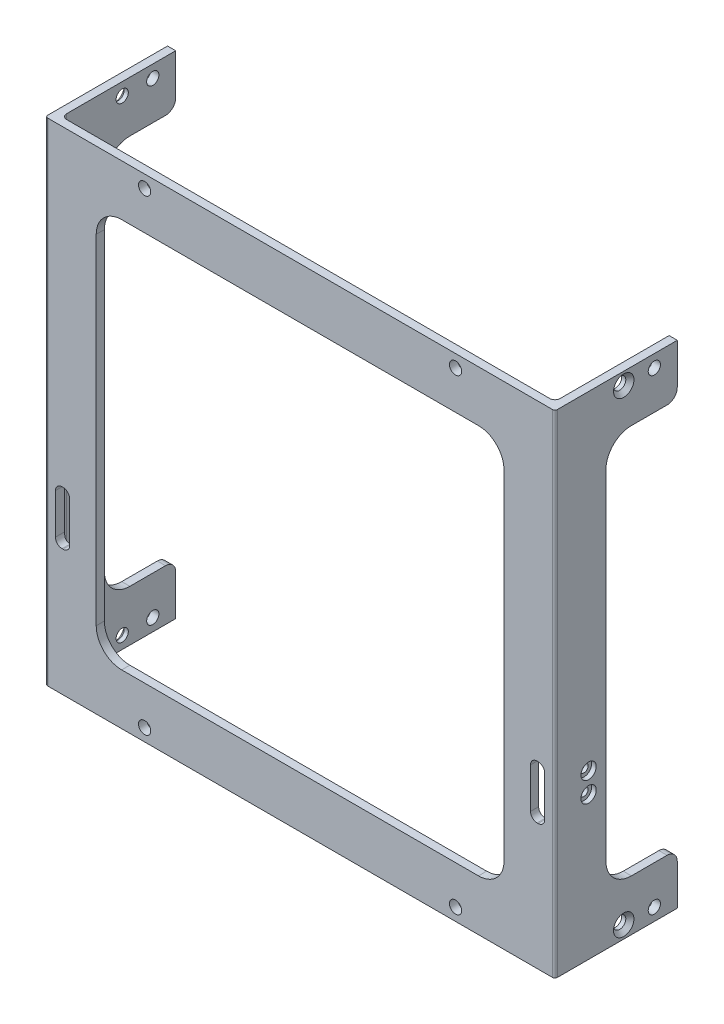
ISO-10303-21;
HEADER;
FILE_DESCRIPTION(('STEP AP214'),'2;1');
FILE_NAME('part.step','',(''),(''),'','','');
FILE_SCHEMA(('AUTOMOTIVE_DESIGN { 1 0 10303 214 1 1 1 1 }'));
ENDSEC;
DATA;
#1=APPLICATION_CONTEXT('core data for automotive mechanical design processes');
#2=APPLICATION_PROTOCOL_DEFINITION('international standard','automotive_design',2000,#1);
#3=PRODUCT_CONTEXT('',#1,'mechanical');
#4=PRODUCT('Part','Part','',(#3));
#5=PRODUCT_RELATED_PRODUCT_CATEGORY('part','',(#4));
#6=PRODUCT_DEFINITION_FORMATION('','',#4);
#7=PRODUCT_DEFINITION_CONTEXT('part definition',#1,'design');
#8=PRODUCT_DEFINITION('design','',#6,#7);
#9=PRODUCT_DEFINITION_SHAPE('','',#8);
#10=(LENGTH_UNIT() NAMED_UNIT(*) SI_UNIT(.MILLI.,.METRE.));
#11=(NAMED_UNIT(*) PLANE_ANGLE_UNIT() SI_UNIT($,.RADIAN.));
#12=(NAMED_UNIT(*) SI_UNIT($,.STERADIAN.) SOLID_ANGLE_UNIT());
#13=UNCERTAINTY_MEASURE_WITH_UNIT(LENGTH_MEASURE(1.E-05),#10,'distance_accuracy_value','');
#14=(GEOMETRIC_REPRESENTATION_CONTEXT(3) GLOBAL_UNCERTAINTY_ASSIGNED_CONTEXT((#13)) GLOBAL_UNIT_ASSIGNED_CONTEXT((#10,
#11,#12)) REPRESENTATION_CONTEXT('',''));
#15=CARTESIAN_POINT('',(0.,0.,0.));
#16=DIRECTION('',(0.,0.,1.));
#17=DIRECTION('',(1.,0.,0.));
#18=AXIS2_PLACEMENT_3D('',#15,#16,#17);
#19=CARTESIAN_POINT('',(49.9999999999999,96.5,-12.));
#20=DIRECTION('',(-1.,0.,0.));
#21=DIRECTION('',(0.,0.,1.));
#22=AXIS2_PLACEMENT_3D('',#19,#20,#21);
#23=PLANE('',#22);
#24=CARTESIAN_POINT('',(50.0000000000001,94.05,-7.5));
#25=DIRECTION('',(1.,0.,0.));
#26=DIRECTION('',(0.,0.,-1.));
#27=AXIS2_PLACEMENT_3D('',#24,#25,#26);
#28=CIRCLE('',#27,1.19999999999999);
#29=CARTESIAN_POINT('',(50.0000000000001,94.05,-8.7));
#30=VERTEX_POINT('',#29);
#31=EDGE_CURVE('E962',#30,#30,#28,.T.);
#32=ORIENTED_EDGE('',*,*,#31,.F.);
#33=EDGE_LOOP('',(#32));
#34=FACE_BOUND('',#33,.T.);
#35=CARTESIAN_POINT('',(50.0000000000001,2.45,-7.5));
#36=DIRECTION('',(1.,0.,0.));
#37=DIRECTION('',(0.,0.,-1.));
#38=AXIS2_PLACEMENT_3D('',#35,#36,#37);
#39=CIRCLE('',#38,1.2);
#40=CARTESIAN_POINT('',(50.0000000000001,2.45,-8.7));
#41=VERTEX_POINT('',#40);
#42=EDGE_CURVE('E979',#41,#41,#39,.T.);
#43=ORIENTED_EDGE('',*,*,#42,.F.);
#44=EDGE_LOOP('',(#43));
#45=FACE_BOUND('',#44,.T.);
#46=CARTESIAN_POINT('',(50.0000000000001,2.45,-1.5));
#47=DIRECTION('',(1.,0.,0.));
#48=DIRECTION('',(0.,0.,-1.));
#49=AXIS2_PLACEMENT_3D('',#46,#47,#48);
#50=CIRCLE('',#49,2.);
#51=CARTESIAN_POINT('',(50.0000000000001,2.45,-3.5));
#52=VERTEX_POINT('',#51);
#53=EDGE_CURVE('E749',#52,#52,#50,.T.);
#54=ORIENTED_EDGE('',*,*,#53,.F.);
#55=EDGE_LOOP('',(#54));
#56=FACE_BOUND('',#55,.T.);
#57=DIRECTION('',(0.,-1.,0.));
#58=VECTOR('',#57,1.);
#59=CARTESIAN_POINT('',(49.9999999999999,96.5,-12.));
#60=LINE('',#59,#58);
#61=CARTESIAN_POINT('',(49.9999999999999,8.00000000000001,-12.));
#62=VERTEX_POINT('',#61);
#63=CARTESIAN_POINT('',(49.9999999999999,0.,-12.));
#64=VERTEX_POINT('',#63);
#65=EDGE_CURVE('E783',#62,#64,#60,.T.);
#66=ORIENTED_EDGE('',*,*,#65,.F.);
#67=CARTESIAN_POINT('',(49.9999999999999,8.,-10.));
#68=DIRECTION('',(-1.,0.,0.));
#69=DIRECTION('',(0.,0.,1.));
#70=AXIS2_PLACEMENT_3D('',#67,#68,#69);
#71=CIRCLE('',#70,2.);
#72=CARTESIAN_POINT('',(49.9999999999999,10.,-10.));
#73=VERTEX_POINT('',#72);
#74=EDGE_CURVE('E848',#62,#73,#71,.F.);
#75=ORIENTED_EDGE('',*,*,#74,.T.);
#76=DIRECTION('',(0.,0.,-1.));
#77=VECTOR('',#76,1.);
#78=CARTESIAN_POINT('',(49.9999999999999,10.,-12.));
#79=LINE('',#78,#77);
#80=CARTESIAN_POINT('',(49.9999999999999,10.,-3.));
#81=VERTEX_POINT('',#80);
#82=EDGE_CURVE('E895',#81,#73,#79,.T.);
#83=ORIENTED_EDGE('',*,*,#82,.F.);
#84=CARTESIAN_POINT('',(49.9999999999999,15.,-3.));
#85=DIRECTION('',(-1.,0.,0.));
#86=DIRECTION('',(0.,0.,1.));
#87=AXIS2_PLACEMENT_3D('',#84,#85,#86);
#88=CIRCLE('',#87,5.);
#89=CARTESIAN_POINT('',(49.9999999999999,15.,2.));
#90=VERTEX_POINT('',#89);
#91=EDGE_CURVE('E511',#81,#90,#88,.T.);
#92=ORIENTED_EDGE('',*,*,#91,.T.);
#93=DIRECTION('',(0.,-1.,0.));
#94=VECTOR('',#93,1.);
#95=CARTESIAN_POINT('',(49.9999999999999,10.,2.));
#96=LINE('',#95,#94);
#97=CARTESIAN_POINT('',(49.9999999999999,81.5,2.));
#98=VERTEX_POINT('',#97);
#99=EDGE_CURVE('E901',#98,#90,#96,.T.);
#100=ORIENTED_EDGE('',*,*,#99,.F.);
#101=CARTESIAN_POINT('',(49.9999999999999,81.5,-3.));
#102=DIRECTION('',(-1.,0.,0.));
#103=DIRECTION('',(0.,0.,1.));
#104=AXIS2_PLACEMENT_3D('',#101,#102,#103);
#105=CIRCLE('',#104,5.);
#106=CARTESIAN_POINT('',(49.9999999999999,86.5,-3.));
#107=VERTEX_POINT('',#106);
#108=EDGE_CURVE('E506',#98,#107,#105,.T.);
#109=ORIENTED_EDGE('',*,*,#108,.T.);
#110=DIRECTION('',(0.,0.,1.));
#111=VECTOR('',#110,1.);
#112=CARTESIAN_POINT('',(49.9999999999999,86.5,2.));
#113=LINE('',#112,#111);
#114=CARTESIAN_POINT('',(49.9999999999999,86.5,-10.));
#115=VERTEX_POINT('',#114);
#116=EDGE_CURVE('E898',#115,#107,#113,.T.);
#117=ORIENTED_EDGE('',*,*,#116,.F.);
#118=CARTESIAN_POINT('',(49.9999999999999,88.5,-10.));
#119=DIRECTION('',(-1.,0.,0.));
#120=DIRECTION('',(0.,0.,1.));
#121=AXIS2_PLACEMENT_3D('',#118,#119,#120);
#122=CIRCLE('',#121,2.);
#123=CARTESIAN_POINT('',(49.9999999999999,88.5,-12.));
#124=VERTEX_POINT('',#123);
#125=EDGE_CURVE('E52',#115,#124,#122,.F.);
#126=ORIENTED_EDGE('',*,*,#125,.T.);
#127=CARTESIAN_POINT('',(49.9999999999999,96.5,-12.));
#128=VERTEX_POINT('',#127);
#129=EDGE_CURVE('E805',#128,#124,#60,.T.);
#130=ORIENTED_EDGE('',*,*,#129,.F.);
#131=DIRECTION('',(0.,0.,-1.));
#132=VECTOR('',#131,1.);
#133=CARTESIAN_POINT('',(49.9999999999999,96.5,-12.));
#134=LINE('',#133,#132);
#135=CARTESIAN_POINT('',(49.9999999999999,96.5,11.5));
#136=VERTEX_POINT('',#135);
#137=EDGE_CURVE('E396',#136,#128,#134,.T.);
#138=ORIENTED_EDGE('',*,*,#137,.F.);
#139=DIRECTION('',(0.,-1.,0.));
#140=VECTOR('',#139,1.);
#141=CARTESIAN_POINT('',(49.9999999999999,96.5,11.5));
#142=LINE('',#141,#140);
#143=CARTESIAN_POINT('',(49.9999999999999,0.,11.5));
#144=VERTEX_POINT('',#143);
#145=EDGE_CURVE('E451',#136,#144,#142,.T.);
#146=ORIENTED_EDGE('',*,*,#145,.T.);
#147=DIRECTION('',(0.,0.,-1.));
#148=VECTOR('',#147,1.);
#149=CARTESIAN_POINT('',(49.9999999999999,0.,-12.));
#150=LINE('',#149,#148);
#151=EDGE_CURVE('E398',#144,#64,#150,.T.);
#152=ORIENTED_EDGE('',*,*,#151,.T.);
#153=EDGE_LOOP('',(#66,#75,#83,#92,#100,#109,#117,#126,#130,#138,#146,#152));
#154=FACE_BOUND('',#153,.T.);
#155=CARTESIAN_POINT('',(50.0000000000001,94.05,-1.5));
#156=DIRECTION('',(1.,0.,0.));
#157=DIRECTION('',(0.,0.,-1.));
#158=AXIS2_PLACEMENT_3D('',#155,#156,#157);
#159=CIRCLE('',#158,2.);
#160=CARTESIAN_POINT('',(50.0000000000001,94.05,-3.5));
#161=VERTEX_POINT('',#160);
#162=EDGE_CURVE('E966',#161,#161,#159,.T.);
#163=ORIENTED_EDGE('',*,*,#162,.F.);
#164=EDGE_LOOP('',(#163));
#165=FACE_BOUND('',#164,.T.);
#166=CARTESIAN_POINT('',(50.0000000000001,28.05,5.4));
#167=DIRECTION('',(1.,0.,0.));
#168=DIRECTION('',(0.,0.,-1.));
#169=AXIS2_PLACEMENT_3D('',#166,#167,#168);
#170=CIRCLE('',#169,1.5);
#171=CARTESIAN_POINT('',(50.0000000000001,28.05,3.9));
#172=VERTEX_POINT('',#171);
#173=EDGE_CURVE('E1846',#172,#172,#170,.T.);
#174=ORIENTED_EDGE('',*,*,#173,.F.);
#175=EDGE_LOOP('',(#174));
#176=FACE_BOUND('',#175,.T.);
#177=CARTESIAN_POINT('',(50.0000000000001,32.05,5.4));
#178=DIRECTION('',(1.,0.,0.));
#179=DIRECTION('',(0.,0.,-1.));
#180=AXIS2_PLACEMENT_3D('',#177,#178,#179);
#181=CIRCLE('',#180,1.5);
#182=CARTESIAN_POINT('',(50.0000000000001,32.05,3.89999999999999));
#183=VERTEX_POINT('',#182);
#184=EDGE_CURVE('E1856',#183,#183,#181,.T.);
#185=ORIENTED_EDGE('',*,*,#184,.F.);
#186=EDGE_LOOP('',(#185));
#187=FACE_BOUND('',#186,.T.);
#188=ADVANCED_FACE('F37',(#34,#45,#56,#154,#165,#176,#187),#23,.F.);
#189=CARTESIAN_POINT('',(48.4,96.5,10.4));
#190=DIRECTION('',(0.,0.,1.));
#191=DIRECTION('',(1.,0.,0.));
#192=AXIS2_PLACEMENT_3D('',#189,#190,#191);
#193=PLANE('',#192);
#194=CARTESIAN_POINT('',(-30.5,2.44999999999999,10.4));
#195=DIRECTION('',(0.,0.,1.));
#196=DIRECTION('',(1.,0.,0.));
#197=AXIS2_PLACEMENT_3D('',#194,#195,#196);
#198=CIRCLE('',#197,1.2);
#199=CARTESIAN_POINT('',(-29.3,2.44999999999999,10.4));
#200=VERTEX_POINT('',#199);
#201=EDGE_CURVE('E746',#200,#200,#198,.T.);
#202=ORIENTED_EDGE('',*,*,#201,.T.);
#203=EDGE_LOOP('',(#202));
#204=FACE_BOUND('',#203,.T.);
#205=CARTESIAN_POINT('',(30.5,2.44999999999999,10.4));
#206=DIRECTION('',(0.,0.,1.));
#207=DIRECTION('',(1.,0.,0.));
#208=AXIS2_PLACEMENT_3D('',#205,#206,#207);
#209=CIRCLE('',#208,1.2);
#210=CARTESIAN_POINT('',(31.7,2.44999999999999,10.4));
#211=VERTEX_POINT('',#210);
#212=EDGE_CURVE('E976',#211,#211,#209,.T.);
#213=ORIENTED_EDGE('',*,*,#212,.T.);
#214=EDGE_LOOP('',(#213));
#215=FACE_BOUND('',#214,.T.);
#216=CARTESIAN_POINT('',(30.5,94.05,10.4));
#217=DIRECTION('',(0.,0.,1.));
#218=DIRECTION('',(1.,0.,0.));
#219=AXIS2_PLACEMENT_3D('',#216,#217,#218);
#220=CIRCLE('',#219,1.2);
#221=CARTESIAN_POINT('',(31.7,94.05,10.4));
#222=VERTEX_POINT('',#221);
#223=EDGE_CURVE('E959',#222,#222,#220,.T.);
#224=ORIENTED_EDGE('',*,*,#223,.T.);
#225=EDGE_LOOP('',(#224));
#226=FACE_BOUND('',#225,.T.);
#227=CARTESIAN_POINT('',(-30.5,94.05,10.4));
#228=DIRECTION('',(0.,0.,1.));
#229=DIRECTION('',(1.,0.,0.));
#230=AXIS2_PLACEMENT_3D('',#227,#228,#229);
#231=CIRCLE('',#230,1.2);
#232=CARTESIAN_POINT('',(-29.3,94.05,10.4));
#233=VERTEX_POINT('',#232);
#234=EDGE_CURVE('E938',#233,#233,#231,.T.);
#235=ORIENTED_EDGE('',*,*,#234,.T.);
#236=EDGE_LOOP('',(#235));
#237=FACE_BOUND('',#236,.T.);
#238=DIRECTION('',(1.,0.,0.));
#239=VECTOR('',#238,1.);
#240=CARTESIAN_POINT('',(39.9999999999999,86.5,10.4));
#241=LINE('',#240,#239);
#242=CARTESIAN_POINT('',(-35.0000000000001,86.5,10.4));
#243=VERTEX_POINT('',#242);
#244=CARTESIAN_POINT('',(34.9999999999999,86.5,10.4));
#245=VERTEX_POINT('',#244);
#246=EDGE_CURVE('E915',#243,#245,#241,.T.);
#247=ORIENTED_EDGE('',*,*,#246,.F.);
#248=CARTESIAN_POINT('',(-35.0000000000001,81.5,10.4));
#249=DIRECTION('',(0.,0.,1.));
#250=DIRECTION('',(1.,0.,0.));
#251=AXIS2_PLACEMENT_3D('',#248,#249,#250);
#252=CIRCLE('',#251,5.);
#253=CARTESIAN_POINT('',(-40.0000000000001,81.5,10.4));
#254=VERTEX_POINT('',#253);
#255=EDGE_CURVE('E527',#243,#254,#252,.T.);
#256=ORIENTED_EDGE('',*,*,#255,.T.);
#257=DIRECTION('',(0.,1.,0.));
#258=VECTOR('',#257,1.);
#259=CARTESIAN_POINT('',(-40.0000000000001,86.5,10.4));
#260=LINE('',#259,#258);
#261=CARTESIAN_POINT('',(-40.0000000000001,15.,10.4));
#262=VERTEX_POINT('',#261);
#263=EDGE_CURVE('E919',#262,#254,#260,.T.);
#264=ORIENTED_EDGE('',*,*,#263,.F.);
#265=CARTESIAN_POINT('',(-35.0000000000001,15.,10.4));
#266=DIRECTION('',(0.,0.,1.));
#267=DIRECTION('',(1.,0.,0.));
#268=AXIS2_PLACEMENT_3D('',#265,#266,#267);
#269=CIRCLE('',#268,5.);
#270=CARTESIAN_POINT('',(-35.0000000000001,10.,10.4));
#271=VERTEX_POINT('',#270);
#272=EDGE_CURVE('E515',#262,#271,#269,.T.);
#273=ORIENTED_EDGE('',*,*,#272,.T.);
#274=DIRECTION('',(-1.,0.,0.));
#275=VECTOR('',#274,1.);
#276=CARTESIAN_POINT('',(-40.0000000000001,10.,10.4));
#277=LINE('',#276,#275);
#278=CARTESIAN_POINT('',(34.9999999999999,10.,10.4));
#279=VERTEX_POINT('',#278);
#280=EDGE_CURVE('E922',#279,#271,#277,.T.);
#281=ORIENTED_EDGE('',*,*,#280,.F.);
#282=CARTESIAN_POINT('',(34.9999999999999,15.,10.4));
#283=DIRECTION('',(0.,0.,1.));
#284=DIRECTION('',(1.,0.,0.));
#285=AXIS2_PLACEMENT_3D('',#282,#283,#284);
#286=CIRCLE('',#285,5.);
#287=CARTESIAN_POINT('',(39.9999999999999,15.,10.4));
#288=VERTEX_POINT('',#287);
#289=EDGE_CURVE('E519',#279,#288,#286,.T.);
#290=ORIENTED_EDGE('',*,*,#289,.T.);
#291=DIRECTION('',(0.,-1.,0.));
#292=VECTOR('',#291,1.);
#293=CARTESIAN_POINT('',(39.9999999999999,10.,10.4));
#294=LINE('',#293,#292);
#295=CARTESIAN_POINT('',(39.9999999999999,81.5,10.4));
#296=VERTEX_POINT('',#295);
#297=EDGE_CURVE('E912',#296,#288,#294,.T.);
#298=ORIENTED_EDGE('',*,*,#297,.F.);
#299=CARTESIAN_POINT('',(34.9999999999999,81.5,10.4));
#300=DIRECTION('',(0.,0.,1.));
#301=DIRECTION('',(1.,0.,0.));
#302=AXIS2_PLACEMENT_3D('',#299,#300,#301);
#303=CIRCLE('',#302,5.);
#304=EDGE_CURVE('E523',#296,#245,#303,.T.);
#305=ORIENTED_EDGE('',*,*,#304,.T.);
#306=EDGE_LOOP('',(#247,#256,#264,#273,#281,#290,#298,#305));
#307=FACE_BOUND('',#306,.T.);
#308=DIRECTION('',(-1.,0.,0.));
#309=VECTOR('',#308,1.);
#310=CARTESIAN_POINT('',(48.4,24.75,10.4));
#311=LINE('',#310,#309);
#312=CARTESIAN_POINT('',(46.7000000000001,24.75,10.4));
#313=VERTEX_POINT('',#312);
#314=CARTESIAN_POINT('',(46.5000000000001,24.75,10.4));
#315=VERTEX_POINT('',#314);
#316=EDGE_CURVE('E1743',#313,#315,#311,.T.);
#317=ORIENTED_EDGE('',*,*,#316,.F.);
#318=CARTESIAN_POINT('',(46.7000000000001,26.05,10.4));
#319=DIRECTION('',(0.,0.,1.));
#320=DIRECTION('',(1.,0.,0.));
#321=AXIS2_PLACEMENT_3D('',#318,#319,#320);
#322=CIRCLE('',#321,1.3);
#323=CARTESIAN_POINT('',(47.4,24.9545548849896,10.4));
#324=VERTEX_POINT('',#323);
#325=EDGE_CURVE('E571',#313,#324,#322,.T.);
#326=ORIENTED_EDGE('',*,*,#325,.T.);
#327=DIRECTION('',(0.,-1.,0.));
#328=VECTOR('',#327,1.);
#329=CARTESIAN_POINT('',(47.4,0.,10.4));
#330=LINE('',#329,#328);
#331=CARTESIAN_POINT('',(47.4,0.,10.4));
#332=VERTEX_POINT('',#331);
#333=EDGE_CURVE('E415',#324,#332,#330,.T.);
#334=ORIENTED_EDGE('',*,*,#333,.T.);
#335=DIRECTION('',(-1.,0.,0.));
#336=VECTOR('',#335,1.);
#337=CARTESIAN_POINT('',(48.4,0.,10.4));
#338=LINE('',#337,#336);
#339=CARTESIAN_POINT('',(-47.4,0.,10.4));
#340=VERTEX_POINT('',#339);
#341=EDGE_CURVE('E788',#332,#340,#338,.T.);
#342=ORIENTED_EDGE('',*,*,#341,.T.);
#343=DIRECTION('',(0.,-1.,0.));
#344=VECTOR('',#343,1.);
#345=CARTESIAN_POINT('',(-47.4,96.5,10.4));
#346=LINE('',#345,#344);
#347=CARTESIAN_POINT('',(-47.4,24.9545548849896,10.4));
#348=VERTEX_POINT('',#347);
#349=EDGE_CURVE('E419',#340,#348,#346,.F.);
#350=ORIENTED_EDGE('',*,*,#349,.T.);
#351=CARTESIAN_POINT('',(-46.7000000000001,26.05,10.4));
#352=DIRECTION('',(0.,0.,1.));
#353=DIRECTION('',(1.,0.,0.));
#354=AXIS2_PLACEMENT_3D('',#351,#352,#353);
#355=CIRCLE('',#354,1.3);
#356=CARTESIAN_POINT('',(-46.7000000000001,24.75,10.4));
#357=VERTEX_POINT('',#356);
#358=EDGE_CURVE('E634',#348,#357,#355,.T.);
#359=ORIENTED_EDGE('',*,*,#358,.T.);
#360=DIRECTION('',(1.,0.,0.));
#361=VECTOR('',#360,1.);
#362=CARTESIAN_POINT('',(48.4,24.75,10.4));
#363=LINE('',#362,#361);
#364=CARTESIAN_POINT('',(-46.5000000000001,24.75,10.4));
#365=VERTEX_POINT('',#364);
#366=EDGE_CURVE('E1703',#357,#365,#363,.T.);
#367=ORIENTED_EDGE('',*,*,#366,.T.);
#368=CARTESIAN_POINT('',(-46.5000000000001,26.05,10.4));
#369=DIRECTION('',(0.,0.,1.));
#370=DIRECTION('',(1.,0.,0.));
#371=AXIS2_PLACEMENT_3D('',#368,#369,#370);
#372=CIRCLE('',#371,1.3);
#373=CARTESIAN_POINT('',(-45.2000000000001,26.05,10.4));
#374=VERTEX_POINT('',#373);
#375=EDGE_CURVE('E1675',#365,#374,#372,.T.);
#376=ORIENTED_EDGE('',*,*,#375,.T.);
#377=DIRECTION('',(0.,1.,0.));
#378=VECTOR('',#377,1.);
#379=CARTESIAN_POINT('',(-45.2000000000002,96.4999999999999,10.4));
#380=LINE('',#379,#378);
#381=CARTESIAN_POINT('',(-45.2000000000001,33.95,10.4));
#382=VERTEX_POINT('',#381);
#383=EDGE_CURVE('E1717',#374,#382,#380,.T.);
#384=ORIENTED_EDGE('',*,*,#383,.T.);
#385=CARTESIAN_POINT('',(-46.5000000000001,33.95,10.4));
#386=DIRECTION('',(0.,0.,1.));
#387=DIRECTION('',(1.,0.,0.));
#388=AXIS2_PLACEMENT_3D('',#385,#386,#387);
#389=CIRCLE('',#388,1.3);
#390=CARTESIAN_POINT('',(-46.5000000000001,35.25,10.4));
#391=VERTEX_POINT('',#390);
#392=EDGE_CURVE('E1684',#382,#391,#389,.T.);
#393=ORIENTED_EDGE('',*,*,#392,.T.);
#394=DIRECTION('',(-1.,0.,0.));
#395=VECTOR('',#394,1.);
#396=CARTESIAN_POINT('',(48.4,35.25,10.4));
#397=LINE('',#396,#395);
#398=CARTESIAN_POINT('',(-46.7000000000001,35.25,10.4));
#399=VERTEX_POINT('',#398);
#400=EDGE_CURVE('E1695',#391,#399,#397,.T.);
#401=ORIENTED_EDGE('',*,*,#400,.T.);
#402=CARTESIAN_POINT('',(-46.7000000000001,33.95,10.4));
#403=DIRECTION('',(0.,0.,1.));
#404=DIRECTION('',(1.,0.,0.));
#405=AXIS2_PLACEMENT_3D('',#402,#403,#404);
#406=CIRCLE('',#405,1.3);
#407=CARTESIAN_POINT('',(-47.4,35.0454451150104,10.4));
#408=VERTEX_POINT('',#407);
#409=EDGE_CURVE('E656',#399,#408,#406,.T.);
#410=ORIENTED_EDGE('',*,*,#409,.T.);
#411=CARTESIAN_POINT('',(-47.4,96.5,10.4));
#412=VERTEX_POINT('',#411);
#413=EDGE_CURVE('E418',#408,#412,#346,.F.);
#414=ORIENTED_EDGE('',*,*,#413,.T.);
#415=DIRECTION('',(-1.,0.,0.));
#416=VECTOR('',#415,1.);
#417=CARTESIAN_POINT('',(48.4,96.5,10.4));
#418=LINE('',#417,#416);
#419=CARTESIAN_POINT('',(47.4,96.5,10.4));
#420=VERTEX_POINT('',#419);
#421=EDGE_CURVE('E389',#420,#412,#418,.T.);
#422=ORIENTED_EDGE('',*,*,#421,.F.);
#423=CARTESIAN_POINT('',(47.4,35.0454451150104,10.4));
#424=VERTEX_POINT('',#423);
#425=EDGE_CURVE('E416',#420,#424,#330,.T.);
#426=ORIENTED_EDGE('',*,*,#425,.T.);
#427=CARTESIAN_POINT('',(46.7000000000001,33.95,10.4));
#428=DIRECTION('',(0.,0.,1.));
#429=DIRECTION('',(1.,0.,0.));
#430=AXIS2_PLACEMENT_3D('',#427,#428,#429);
#431=CIRCLE('',#430,1.3);
#432=CARTESIAN_POINT('',(46.7000000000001,35.25,10.4));
#433=VERTEX_POINT('',#432);
#434=EDGE_CURVE('E621',#424,#433,#431,.T.);
#435=ORIENTED_EDGE('',*,*,#434,.T.);
#436=DIRECTION('',(1.,0.,0.));
#437=VECTOR('',#436,1.);
#438=CARTESIAN_POINT('',(48.4,35.25,10.4));
#439=LINE('',#438,#437);
#440=CARTESIAN_POINT('',(46.5000000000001,35.25,10.4));
#441=VERTEX_POINT('',#440);
#442=EDGE_CURVE('E1738',#441,#433,#439,.T.);
#443=ORIENTED_EDGE('',*,*,#442,.F.);
#444=CARTESIAN_POINT('',(46.5000000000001,33.95,10.4));
#445=DIRECTION('',(0.,0.,1.));
#446=DIRECTION('',(1.,0.,0.));
#447=AXIS2_PLACEMENT_3D('',#444,#445,#446);
#448=CIRCLE('',#447,1.3);
#449=CARTESIAN_POINT('',(45.2000000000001,33.95,10.4));
#450=VERTEX_POINT('',#449);
#451=EDGE_CURVE('E1822',#441,#450,#448,.T.);
#452=ORIENTED_EDGE('',*,*,#451,.T.);
#453=DIRECTION('',(0.,1.,0.));
#454=VECTOR('',#453,1.);
#455=CARTESIAN_POINT('',(45.2000000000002,96.5,10.4));
#456=LINE('',#455,#454);
#457=CARTESIAN_POINT('',(45.2000000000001,26.05,10.4));
#458=VERTEX_POINT('',#457);
#459=EDGE_CURVE('E1747',#458,#450,#456,.T.);
#460=ORIENTED_EDGE('',*,*,#459,.F.);
#461=CARTESIAN_POINT('',(46.5000000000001,26.05,10.4));
#462=DIRECTION('',(0.,0.,1.));
#463=DIRECTION('',(1.,0.,0.));
#464=AXIS2_PLACEMENT_3D('',#461,#462,#463);
#465=CIRCLE('',#464,1.3);
#466=EDGE_CURVE('E1824',#458,#315,#465,.T.);
#467=ORIENTED_EDGE('',*,*,#466,.T.);
#468=EDGE_LOOP('',(#317,#326,#334,#342,#350,#359,#367,#376,#384,#393,#401,#410,#414,#422,#426,
#435,#443,#452,#460,#467));
#469=FACE_BOUND('',#468,.T.);
#470=ADVANCED_FACE('F682',(#204,#215,#226,#237,#307,#469),#193,.F.);
#471=CARTESIAN_POINT('',(49.9999999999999,96.5,12.));
#472=DIRECTION('',(0.,0.,-1.));
#473=DIRECTION('',(-1.,0.,0.));
#474=AXIS2_PLACEMENT_3D('',#471,#472,#473);
#475=PLANE('',#474);
#476=DIRECTION('',(1.,0.,0.));
#477=VECTOR('',#476,1.);
#478=CARTESIAN_POINT('',(49.9999999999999,96.5,12.));
#479=LINE('',#478,#477);
#480=CARTESIAN_POINT('',(-49.5000000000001,96.5,12.));
#481=VERTEX_POINT('',#480);
#482=CARTESIAN_POINT('',(49.4999999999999,96.5,12.));
#483=VERTEX_POINT('',#482);
#484=EDGE_CURVE('E779',#481,#483,#479,.T.);
#485=ORIENTED_EDGE('',*,*,#484,.F.);
#486=DIRECTION('',(0.,-1.,0.));
#487=VECTOR('',#486,1.);
#488=CARTESIAN_POINT('',(-49.5000000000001,96.5,12.));
#489=LINE('',#488,#487);
#490=CARTESIAN_POINT('',(-49.5000000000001,0.,12.));
#491=VERTEX_POINT('',#490);
#492=EDGE_CURVE('E438',#481,#491,#489,.T.);
#493=ORIENTED_EDGE('',*,*,#492,.T.);
#494=DIRECTION('',(1.,0.,0.));
#495=VECTOR('',#494,1.);
#496=CARTESIAN_POINT('',(49.9999999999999,0.,12.));
#497=LINE('',#496,#495);
#498=CARTESIAN_POINT('',(49.4999999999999,0.,12.));
#499=VERTEX_POINT('',#498);
#500=EDGE_CURVE('E800',#491,#499,#497,.T.);
#501=ORIENTED_EDGE('',*,*,#500,.T.);
#502=DIRECTION('',(0.,-1.,0.));
#503=VECTOR('',#502,1.);
#504=CARTESIAN_POINT('',(49.4999999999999,96.5,12.));
#505=LINE('',#504,#503);
#506=EDGE_CURVE('E436',#499,#483,#505,.F.);
#507=ORIENTED_EDGE('',*,*,#506,.T.);
#508=EDGE_LOOP('',(#485,#493,#501,#507));
#509=FACE_BOUND('',#508,.T.);
#510=CARTESIAN_POINT('',(-30.5,2.44999999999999,12.));
#511=DIRECTION('',(0.,0.,1.));
#512=DIRECTION('',(1.,0.,0.));
#513=AXIS2_PLACEMENT_3D('',#510,#511,#512);
#514=CIRCLE('',#513,1.2);
#515=CARTESIAN_POINT('',(-29.3,2.44999999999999,12.));
#516=VERTEX_POINT('',#515);
#517=EDGE_CURVE('E742',#516,#516,#514,.T.);
#518=ORIENTED_EDGE('',*,*,#517,.F.);
#519=EDGE_LOOP('',(#518));
#520=FACE_BOUND('',#519,.T.);
#521=CARTESIAN_POINT('',(30.5,2.44999999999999,12.));
#522=DIRECTION('',(0.,0.,1.));
#523=DIRECTION('',(1.,0.,0.));
#524=AXIS2_PLACEMENT_3D('',#521,#522,#523);
#525=CIRCLE('',#524,1.2);
#526=CARTESIAN_POINT('',(31.7,2.44999999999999,12.));
#527=VERTEX_POINT('',#526);
#528=EDGE_CURVE('E973',#527,#527,#525,.T.);
#529=ORIENTED_EDGE('',*,*,#528,.F.);
#530=EDGE_LOOP('',(#529));
#531=FACE_BOUND('',#530,.T.);
#532=CARTESIAN_POINT('',(30.5,94.05,12.));
#533=DIRECTION('',(0.,0.,1.));
#534=DIRECTION('',(1.,0.,0.));
#535=AXIS2_PLACEMENT_3D('',#532,#533,#534);
#536=CIRCLE('',#535,1.2);
#537=CARTESIAN_POINT('',(31.7,94.05,12.));
#538=VERTEX_POINT('',#537);
#539=EDGE_CURVE('E956',#538,#538,#536,.T.);
#540=ORIENTED_EDGE('',*,*,#539,.F.);
#541=EDGE_LOOP('',(#540));
#542=FACE_BOUND('',#541,.T.);
#543=CARTESIAN_POINT('',(-30.5,94.05,12.));
#544=DIRECTION('',(0.,0.,1.));
#545=DIRECTION('',(1.,0.,0.));
#546=AXIS2_PLACEMENT_3D('',#543,#544,#545);
#547=CIRCLE('',#546,1.2);
#548=CARTESIAN_POINT('',(-29.3,94.05,12.));
#549=VERTEX_POINT('',#548);
#550=EDGE_CURVE('E935',#549,#549,#547,.T.);
#551=ORIENTED_EDGE('',*,*,#550,.F.);
#552=EDGE_LOOP('',(#551));
#553=FACE_BOUND('',#552,.T.);
#554=DIRECTION('',(1.,0.,0.));
#555=VECTOR('',#554,1.);
#556=CARTESIAN_POINT('',(-40.0000000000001,10.,12.));
#557=LINE('',#556,#555);
#558=CARTESIAN_POINT('',(-35.0000000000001,10.,12.));
#559=VERTEX_POINT('',#558);
#560=CARTESIAN_POINT('',(34.9999999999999,10.,12.));
#561=VERTEX_POINT('',#560);
#562=EDGE_CURVE('E925',#559,#561,#557,.T.);
#563=ORIENTED_EDGE('',*,*,#562,.F.);
#564=CARTESIAN_POINT('',(-35.0000000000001,15.,12.));
#565=DIRECTION('',(0.,0.,-1.));
#566=DIRECTION('',(-1.,0.,0.));
#567=AXIS2_PLACEMENT_3D('',#564,#565,#566);
#568=CIRCLE('',#567,5.);
#569=CARTESIAN_POINT('',(-40.0000000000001,15.,12.));
#570=VERTEX_POINT('',#569);
#571=EDGE_CURVE('E513',#559,#570,#568,.T.);
#572=ORIENTED_EDGE('',*,*,#571,.T.);
#573=DIRECTION('',(0.,-1.,0.));
#574=VECTOR('',#573,1.);
#575=CARTESIAN_POINT('',(-40.0000000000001,86.5,12.));
#576=LINE('',#575,#574);
#577=CARTESIAN_POINT('',(-40.0000000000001,81.5,12.));
#578=VERTEX_POINT('',#577);
#579=EDGE_CURVE('E911',#578,#570,#576,.T.);
#580=ORIENTED_EDGE('',*,*,#579,.F.);
#581=CARTESIAN_POINT('',(-35.0000000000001,81.5,12.));
#582=DIRECTION('',(0.,0.,-1.));
#583=DIRECTION('',(-1.,0.,0.));
#584=AXIS2_PLACEMENT_3D('',#581,#582,#583);
#585=CIRCLE('',#584,5.);
#586=CARTESIAN_POINT('',(-35.0000000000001,86.5,12.));
#587=VERTEX_POINT('',#586);
#588=EDGE_CURVE('E525',#578,#587,#585,.T.);
#589=ORIENTED_EDGE('',*,*,#588,.T.);
#590=DIRECTION('',(-1.,0.,0.));
#591=VECTOR('',#590,1.);
#592=CARTESIAN_POINT('',(39.9999999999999,86.5,12.));
#593=LINE('',#592,#591);
#594=CARTESIAN_POINT('',(34.9999999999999,86.5,12.));
#595=VERTEX_POINT('',#594);
#596=EDGE_CURVE('E916',#595,#587,#593,.T.);
#597=ORIENTED_EDGE('',*,*,#596,.F.);
#598=CARTESIAN_POINT('',(34.9999999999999,81.5,12.));
#599=DIRECTION('',(0.,0.,-1.));
#600=DIRECTION('',(-1.,0.,0.));
#601=AXIS2_PLACEMENT_3D('',#598,#599,#600);
#602=CIRCLE('',#601,5.);
#603=CARTESIAN_POINT('',(39.9999999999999,81.5,12.));
#604=VERTEX_POINT('',#603);
#605=EDGE_CURVE('E521',#595,#604,#602,.T.);
#606=ORIENTED_EDGE('',*,*,#605,.T.);
#607=DIRECTION('',(0.,1.,0.));
#608=VECTOR('',#607,1.);
#609=CARTESIAN_POINT('',(39.9999999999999,10.,12.));
#610=LINE('',#609,#608);
#611=CARTESIAN_POINT('',(39.9999999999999,15.,12.));
#612=VERTEX_POINT('',#611);
#613=EDGE_CURVE('E928',#612,#604,#610,.T.);
#614=ORIENTED_EDGE('',*,*,#613,.F.);
#615=CARTESIAN_POINT('',(34.9999999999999,15.,12.));
#616=DIRECTION('',(0.,0.,-1.));
#617=DIRECTION('',(-1.,0.,0.));
#618=AXIS2_PLACEMENT_3D('',#615,#616,#617);
#619=CIRCLE('',#618,5.);
#620=EDGE_CURVE('E517',#612,#561,#619,.T.);
#621=ORIENTED_EDGE('',*,*,#620,.T.);
#622=EDGE_LOOP('',(#563,#572,#580,#589,#597,#606,#614,#621));
#623=FACE_BOUND('',#622,.T.);
#624=DIRECTION('',(1.,0.,0.));
#625=VECTOR('',#624,1.);
#626=CARTESIAN_POINT('',(-48.0000000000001,24.75,12.));
#627=LINE('',#626,#625);
#628=CARTESIAN_POINT('',(-46.7000000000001,24.75,12.));
#629=VERTEX_POINT('',#628);
#630=CARTESIAN_POINT('',(-46.5000000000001,24.75,12.));
#631=VERTEX_POINT('',#630);
#632=EDGE_CURVE('E1701',#629,#631,#627,.T.);
#633=ORIENTED_EDGE('',*,*,#632,.F.);
#634=CARTESIAN_POINT('',(-46.7000000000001,26.05,12.));
#635=DIRECTION('',(0.,0.,-1.));
#636=DIRECTION('',(-1.,0.,0.));
#637=AXIS2_PLACEMENT_3D('',#634,#635,#636);
#638=CIRCLE('',#637,1.3);
#639=CARTESIAN_POINT('',(-48.0000000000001,26.05,12.));
#640=VERTEX_POINT('',#639);
#641=EDGE_CURVE('E625',#629,#640,#638,.T.);
#642=ORIENTED_EDGE('',*,*,#641,.T.);
#643=DIRECTION('',(0.,-1.,0.));
#644=VECTOR('',#643,1.);
#645=CARTESIAN_POINT('',(-48.0000000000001,35.25,12.));
#646=LINE('',#645,#644);
#647=CARTESIAN_POINT('',(-48.0000000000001,33.95,12.));
#648=VERTEX_POINT('',#647);
#649=EDGE_CURVE('E1700',#648,#640,#646,.T.);
#650=ORIENTED_EDGE('',*,*,#649,.F.);
#651=CARTESIAN_POINT('',(-46.7000000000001,33.95,12.));
#652=DIRECTION('',(0.,0.,-1.));
#653=DIRECTION('',(-1.,0.,0.));
#654=AXIS2_PLACEMENT_3D('',#651,#652,#653);
#655=CIRCLE('',#654,1.3);
#656=CARTESIAN_POINT('',(-46.7000000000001,35.25,12.));
#657=VERTEX_POINT('',#656);
#658=EDGE_CURVE('E1685',#648,#657,#655,.T.);
#659=ORIENTED_EDGE('',*,*,#658,.T.);
#660=DIRECTION('',(-1.,0.,0.));
#661=VECTOR('',#660,1.);
#662=CARTESIAN_POINT('',(-48.0000000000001,35.25,12.));
#663=LINE('',#662,#661);
#664=CARTESIAN_POINT('',(-46.5000000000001,35.25,12.));
#665=VERTEX_POINT('',#664);
#666=EDGE_CURVE('E1708',#665,#657,#663,.T.);
#667=ORIENTED_EDGE('',*,*,#666,.F.);
#668=CARTESIAN_POINT('',(-46.5000000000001,33.95,12.));
#669=DIRECTION('',(0.,0.,-1.));
#670=DIRECTION('',(-1.,0.,0.));
#671=AXIS2_PLACEMENT_3D('',#668,#669,#670);
#672=CIRCLE('',#671,1.3);
#673=CARTESIAN_POINT('',(-45.2000000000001,33.95,12.));
#674=VERTEX_POINT('',#673);
#675=EDGE_CURVE('E1680',#665,#674,#672,.T.);
#676=ORIENTED_EDGE('',*,*,#675,.T.);
#677=DIRECTION('',(0.,1.,0.));
#678=VECTOR('',#677,1.);
#679=CARTESIAN_POINT('',(-45.2000000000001,35.25,12.));
#680=LINE('',#679,#678);
#681=CARTESIAN_POINT('',(-45.2000000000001,26.05,12.));
#682=VERTEX_POINT('',#681);
#683=EDGE_CURVE('E1705',#682,#674,#680,.T.);
#684=ORIENTED_EDGE('',*,*,#683,.F.);
#685=CARTESIAN_POINT('',(-46.5000000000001,26.05,12.));
#686=DIRECTION('',(0.,0.,-1.));
#687=DIRECTION('',(-1.,0.,0.));
#688=AXIS2_PLACEMENT_3D('',#685,#686,#687);
#689=CIRCLE('',#688,1.3);
#690=EDGE_CURVE('E1674',#682,#631,#689,.T.);
#691=ORIENTED_EDGE('',*,*,#690,.T.);
#692=EDGE_LOOP('',(#633,#642,#650,#659,#667,#676,#684,#691));
#693=FACE_BOUND('',#692,.T.);
#694=DIRECTION('',(1.,0.,0.));
#695=VECTOR('',#694,1.);
#696=CARTESIAN_POINT('',(48.0000000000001,35.25,12.));
#697=LINE('',#696,#695);
#698=CARTESIAN_POINT('',(46.5000000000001,35.25,12.));
#699=VERTEX_POINT('',#698);
#700=CARTESIAN_POINT('',(46.7000000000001,35.25,12.));
#701=VERTEX_POINT('',#700);
#702=EDGE_CURVE('E1828',#699,#701,#697,.T.);
#703=ORIENTED_EDGE('',*,*,#702,.T.);
#704=CARTESIAN_POINT('',(46.7000000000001,33.95,12.));
#705=DIRECTION('',(0.,0.,-1.));
#706=DIRECTION('',(-1.,0.,0.));
#707=AXIS2_PLACEMENT_3D('',#704,#705,#706);
#708=CIRCLE('',#707,1.3);
#709=CARTESIAN_POINT('',(48.0000000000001,33.95,12.));
#710=VERTEX_POINT('',#709);
#711=EDGE_CURVE('E622',#701,#710,#708,.T.);
#712=ORIENTED_EDGE('',*,*,#711,.T.);
#713=DIRECTION('',(0.,-1.,0.));
#714=VECTOR('',#713,1.);
#715=CARTESIAN_POINT('',(48.0000000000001,35.25,12.));
#716=LINE('',#715,#714);
#717=CARTESIAN_POINT('',(48.0000000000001,26.05,12.));
#718=VERTEX_POINT('',#717);
#719=EDGE_CURVE('E1835',#710,#718,#716,.T.);
#720=ORIENTED_EDGE('',*,*,#719,.T.);
#721=CARTESIAN_POINT('',(46.7000000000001,26.05,12.));
#722=DIRECTION('',(0.,0.,-1.));
#723=DIRECTION('',(-1.,0.,0.));
#724=AXIS2_PLACEMENT_3D('',#721,#722,#723);
#725=CIRCLE('',#724,1.3);
#726=CARTESIAN_POINT('',(46.7000000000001,24.75,12.));
#727=VERTEX_POINT('',#726);
#728=EDGE_CURVE('E569',#718,#727,#725,.T.);
#729=ORIENTED_EDGE('',*,*,#728,.T.);
#730=DIRECTION('',(-1.,0.,0.));
#731=VECTOR('',#730,1.);
#732=CARTESIAN_POINT('',(48.0000000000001,24.75,12.));
#733=LINE('',#732,#731);
#734=CARTESIAN_POINT('',(46.5000000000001,24.75,12.));
#735=VERTEX_POINT('',#734);
#736=EDGE_CURVE('E1744',#727,#735,#733,.T.);
#737=ORIENTED_EDGE('',*,*,#736,.T.);
#738=CARTESIAN_POINT('',(46.5000000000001,26.05,12.));
#739=DIRECTION('',(0.,0.,-1.));
#740=DIRECTION('',(-1.,0.,0.));
#741=AXIS2_PLACEMENT_3D('',#738,#739,#740);
#742=CIRCLE('',#741,1.3);
#743=CARTESIAN_POINT('',(45.2000000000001,26.05,12.));
#744=VERTEX_POINT('',#743);
#745=EDGE_CURVE('E582',#735,#744,#742,.T.);
#746=ORIENTED_EDGE('',*,*,#745,.T.);
#747=DIRECTION('',(0.,1.,0.));
#748=VECTOR('',#747,1.);
#749=CARTESIAN_POINT('',(45.2000000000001,35.25,12.));
#750=LINE('',#749,#748);
#751=CARTESIAN_POINT('',(45.2000000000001,33.95,12.));
#752=VERTEX_POINT('',#751);
#753=EDGE_CURVE('E1750',#744,#752,#750,.T.);
#754=ORIENTED_EDGE('',*,*,#753,.T.);
#755=CARTESIAN_POINT('',(46.5000000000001,33.95,12.));
#756=DIRECTION('',(0.,0.,-1.));
#757=DIRECTION('',(-1.,0.,0.));
#758=AXIS2_PLACEMENT_3D('',#755,#756,#757);
#759=CIRCLE('',#758,1.3);
#760=EDGE_CURVE('E1823',#752,#699,#759,.T.);
#761=ORIENTED_EDGE('',*,*,#760,.T.);
#762=EDGE_LOOP('',(#703,#712,#720,#729,#737,#746,#754,#761));
#763=FACE_BOUND('',#762,.T.);
#764=ADVANCED_FACE('F688',(#509,#520,#531,#542,#553,#623,#693,#763),#475,.F.);
#765=CARTESIAN_POINT('',(47.4,96.5,9.4));
#766=DIRECTION('',(0.,1.,0.));
#767=DIRECTION('',(0.,0.,1.));
#768=AXIS2_PLACEMENT_3D('',#765,#766,#767);
#769=CYLINDRICAL_SURFACE('',#768,1.);
#770=ORIENTED_EDGE('',*,*,#333,.F.);
#771=CARTESIAN_POINT('',(47.4,24.9545548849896,10.4));
#772=CARTESIAN_POINT('',(47.4274033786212,24.9720609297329,10.4000006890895));
#773=CARTESIAN_POINT('',(47.4541146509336,24.9905828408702,10.398873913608));
#774=CARTESIAN_POINT('',(47.5059459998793,25.0294626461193,10.3947109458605));
#775=CARTESIAN_POINT('',(47.5310685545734,25.0498175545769,10.3916778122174));
#776=CARTESIAN_POINT('',(47.6034313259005,25.1130431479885,10.3802985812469));
#777=CARTESIAN_POINT('',(47.6481692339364,25.1583984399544,10.3696599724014));
#778=CARTESIAN_POINT('',(47.7298980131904,25.2542219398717,10.3449779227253));
#779=CARTESIAN_POINT('',(47.7669315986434,25.3046595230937,10.3309542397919));
#780=CARTESIAN_POINT('',(47.8334424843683,25.4102939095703,10.3019127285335));
#781=CARTESIAN_POINT('',(47.8628888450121,25.4655090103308,10.2868911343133));
#782=CARTESIAN_POINT('',(47.9185030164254,25.5908877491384,10.2557799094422));
#783=CARTESIAN_POINT('',(47.9430000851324,25.6619046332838,10.2400247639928));
#784=CARTESIAN_POINT('',(47.9703540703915,25.7714082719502,10.2214712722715));
#785=CARTESIAN_POINT('',(47.9779020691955,25.8083428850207,10.216137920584));
#786=CARTESIAN_POINT('',(47.9897748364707,25.8829575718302,10.2076017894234));
#787=CARTESIAN_POINT('',(47.9941029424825,25.9206368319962,10.2043968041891));
#788=CARTESIAN_POINT('',(47.9978486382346,25.9736955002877,10.2016097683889));
#789=CARTESIAN_POINT('',(47.9986549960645,25.9889383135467,10.20100729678));
#790=CARTESIAN_POINT('',(47.9997306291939,26.0194530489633,10.2002022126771));
#791=CARTESIAN_POINT('',(47.9999999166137,26.0347249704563,10.1999995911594));
#792=CARTESIAN_POINT('',(48.0000000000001,26.05,10.1999999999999));
#793=B_SPLINE_CURVE_WITH_KNOTS('',3,(#771,#772,#773,#774,#775,#776,#777,#778,#779,#780,#781,
#782,#783,#784,#785,#786,#787,#788,#789,#790,#791,#792),.UNSPECIFIED.,.F.,.F.,(4,2,2,2,2,2,2,2,
2,2,4),(0.,0.0974519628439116,0.194747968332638,0.38757281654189,0.579298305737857,
0.771793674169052,1.00066054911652,1.11472056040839,1.22866217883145,1.27447846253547,
1.32029371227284),.UNSPECIFIED.);
#794=CARTESIAN_POINT('',(48.0000000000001,26.05,10.1999999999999));
#795=VERTEX_POINT('',#794);
#796=EDGE_CURVE('E574',#324,#795,#793,.T.);
#797=ORIENTED_EDGE('',*,*,#796,.T.);
#798=DIRECTION('',(0.,1.,0.));
#799=VECTOR('',#798,1.);
#800=CARTESIAN_POINT('',(48.0000000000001,96.5,10.1999999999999));
#801=LINE('',#800,#799);
#802=CARTESIAN_POINT('',(48.0000000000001,33.95,10.1999999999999));
#803=VERTEX_POINT('',#802);
#804=EDGE_CURVE('E433',#803,#795,#801,.F.);
#805=ORIENTED_EDGE('',*,*,#804,.F.);
#806=CARTESIAN_POINT('',(48.0000000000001,33.95,10.1999999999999));
#807=CARTESIAN_POINT('',(48.0000067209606,33.9826293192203,10.1999777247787));
#808=CARTESIAN_POINT('',(47.998771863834,34.0152472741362,10.2009209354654));
#809=CARTESIAN_POINT('',(47.9938746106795,34.0801606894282,10.2045678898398));
#810=CARTESIAN_POINT('',(47.9902153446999,34.1124565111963,10.2072693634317));
#811=CARTESIAN_POINT('',(47.9805677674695,34.1762262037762,10.2142320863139));
#812=CARTESIAN_POINT('',(47.9746004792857,34.2077048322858,10.2184792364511));
#813=CARTESIAN_POINT('',(47.9604177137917,34.2699479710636,10.2282550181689));
#814=CARTESIAN_POINT('',(47.952201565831,34.3007122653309,10.2337840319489));
#815=CARTESIAN_POINT('',(47.9243952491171,34.3914065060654,10.2517603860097));
#816=CARTESIAN_POINT('',(47.9015919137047,34.4500942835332,10.2656424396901));
#817=CARTESIAN_POINT('',(47.8478374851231,34.5635401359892,10.2946370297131));
#818=CARTESIAN_POINT('',(47.816851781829,34.6182802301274,10.3097545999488));
#819=CARTESIAN_POINT('',(47.740910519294,34.732301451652,10.3411487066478));
#820=CARTESIAN_POINT('',(47.6944524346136,34.7906683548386,10.3571559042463));
#821=CARTESIAN_POINT('',(47.5914791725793,34.89909770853,10.3829138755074));
#822=CARTESIAN_POINT('',(47.5350208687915,34.9492041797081,10.3926986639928));
#823=CARTESIAN_POINT('',(47.4623763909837,35.0030964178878,10.3981269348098));
#824=CARTESIAN_POINT('',(47.4501173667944,35.0118628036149,10.3988208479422));
#825=CARTESIAN_POINT('',(47.4252875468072,35.0289735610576,10.3997571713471));
#826=CARTESIAN_POINT('',(47.4127166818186,35.0373178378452,10.3999994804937));
#827=CARTESIAN_POINT('',(47.4,35.0454451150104,10.4));
#828=B_SPLINE_CURVE_WITH_KNOTS('',3,(#806,#807,#808,#809,#810,#811,#812,#813,#814,#815,#816,
#817,#818,#819,#820,#821,#822,#823,#824,#825,#826,#827),.UNSPECIFIED.,.F.,.F.,(4,2,2,2,2,2,2,2,
2,2,4),(0.,0.0978326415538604,0.195539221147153,0.292376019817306,0.389241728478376,
0.581894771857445,0.775376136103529,1.00314324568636,1.22965431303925,1.27490432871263,
1.32016447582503),.UNSPECIFIED.);
#829=EDGE_CURVE('E613',#803,#424,#828,.T.);
#830=ORIENTED_EDGE('',*,*,#829,.T.);
#831=ORIENTED_EDGE('',*,*,#425,.F.);
#832=CARTESIAN_POINT('',(47.4,96.5,9.4));
#833=DIRECTION('',(0.,-1.,0.));
#834=DIRECTION('',(0.,0.,-1.));
#835=AXIS2_PLACEMENT_3D('',#832,#833,#834);
#836=CIRCLE('',#835,1.);
#837=CARTESIAN_POINT('',(48.4,96.5,9.4));
#838=VERTEX_POINT('',#837);
#839=EDGE_CURVE('E428',#838,#420,#836,.T.);
#840=ORIENTED_EDGE('',*,*,#839,.F.);
#841=DIRECTION('',(0.,-1.,0.));
#842=VECTOR('',#841,1.);
#843=CARTESIAN_POINT('',(48.4,96.5,9.4));
#844=LINE('',#843,#842);
#845=CARTESIAN_POINT('',(48.4,0.,9.4));
#846=VERTEX_POINT('',#845);
#847=EDGE_CURVE('E386',#846,#838,#844,.F.);
#848=ORIENTED_EDGE('',*,*,#847,.F.);
#849=CARTESIAN_POINT('',(47.4,0.,9.4));
#850=DIRECTION('',(0.,-1.,0.));
#851=DIRECTION('',(0.,0.,-1.));
#852=AXIS2_PLACEMENT_3D('',#849,#850,#851);
#853=CIRCLE('',#852,1.);
#854=EDGE_CURVE('E426',#332,#846,#853,.F.);
#855=ORIENTED_EDGE('',*,*,#854,.F.);
#856=EDGE_LOOP('',(#770,#797,#805,#830,#831,#840,#848,#855));
#857=FACE_BOUND('',#856,.T.);
#858=ADVANCED_FACE('F584',(#857),#769,.F.);
#859=CARTESIAN_POINT('',(-50.0000000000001,96.5,-12.));
#860=DIRECTION('',(1.,0.,0.));
#861=DIRECTION('',(0.,0.,-1.));
#862=AXIS2_PLACEMENT_3D('',#859,#860,#861);
#863=PLANE('',#862);
#864=CARTESIAN_POINT('',(-50.0000000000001,28.05,5.4));
#865=DIRECTION('',(-1.,0.,0.));
#866=DIRECTION('',(0.,0.,1.));
#867=AXIS2_PLACEMENT_3D('',#864,#865,#866);
#868=CIRCLE('',#867,1.5);
#869=CARTESIAN_POINT('',(-50.0000000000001,28.05,6.9));
#870=VERTEX_POINT('',#869);
#871=EDGE_CURVE('E1768',#870,#870,#868,.T.);
#872=ORIENTED_EDGE('',*,*,#871,.F.);
#873=EDGE_LOOP('',(#872));
#874=FACE_BOUND('',#873,.T.);
#875=CARTESIAN_POINT('',(-50.0000000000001,94.05,-7.5));
#876=DIRECTION('',(-1.,0.,0.));
#877=DIRECTION('',(0.,0.,1.));
#878=AXIS2_PLACEMENT_3D('',#875,#876,#877);
#879=CIRCLE('',#878,1.19999999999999);
#880=CARTESIAN_POINT('',(-50.0000000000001,94.05,-6.30000000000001));
#881=VERTEX_POINT('',#880);
#882=EDGE_CURVE('E941',#881,#881,#879,.T.);
#883=ORIENTED_EDGE('',*,*,#882,.F.);
#884=EDGE_LOOP('',(#883));
#885=FACE_BOUND('',#884,.T.);
#886=CARTESIAN_POINT('',(-50.0000000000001,94.05,-1.5));
#887=DIRECTION('',(-1.,0.,0.));
#888=DIRECTION('',(0.,0.,1.));
#889=AXIS2_PLACEMENT_3D('',#886,#887,#888);
#890=CIRCLE('',#889,2.);
#891=CARTESIAN_POINT('',(-50.0000000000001,94.05,0.499999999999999));
#892=VERTEX_POINT('',#891);
#893=EDGE_CURVE('E947',#892,#892,#890,.T.);
#894=ORIENTED_EDGE('',*,*,#893,.F.);
#895=EDGE_LOOP('',(#894));
#896=FACE_BOUND('',#895,.T.);
#897=CARTESIAN_POINT('',(-50.0000000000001,2.45,-1.5));
#898=DIRECTION('',(-1.,0.,0.));
#899=DIRECTION('',(0.,0.,1.));
#900=AXIS2_PLACEMENT_3D('',#897,#898,#899);
#901=CIRCLE('',#900,2.);
#902=CARTESIAN_POINT('',(-50.0000000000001,2.45,0.499999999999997));
#903=VERTEX_POINT('',#902);
#904=EDGE_CURVE('E761',#903,#903,#901,.T.);
#905=ORIENTED_EDGE('',*,*,#904,.F.);
#906=EDGE_LOOP('',(#905));
#907=FACE_BOUND('',#906,.T.);
#908=DIRECTION('',(0.,0.,1.));
#909=VECTOR('',#908,1.);
#910=CARTESIAN_POINT('',(-50.0000000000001,10.,-12.));
#911=LINE('',#910,#909);
#912=CARTESIAN_POINT('',(-50.0000000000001,10.,-10.));
#913=VERTEX_POINT('',#912);
#914=CARTESIAN_POINT('',(-50.0000000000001,10.,-3.));
#915=VERTEX_POINT('',#914);
#916=EDGE_CURVE('E1720',#913,#915,#911,.T.);
#917=ORIENTED_EDGE('',*,*,#916,.F.);
#918=CARTESIAN_POINT('',(-50.0000000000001,8.00000000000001,-10.));
#919=DIRECTION('',(1.,0.,0.));
#920=DIRECTION('',(0.,0.,-1.));
#921=AXIS2_PLACEMENT_3D('',#918,#919,#920);
#922=CIRCLE('',#921,2.);
#923=CARTESIAN_POINT('',(-50.0000000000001,8.00000000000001,-12.));
#924=VERTEX_POINT('',#923);
#925=EDGE_CURVE('E819',#913,#924,#922,.F.);
#926=ORIENTED_EDGE('',*,*,#925,.T.);
#927=DIRECTION('',(0.,-1.,0.));
#928=VECTOR('',#927,1.);
#929=CARTESIAN_POINT('',(-50.0000000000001,96.5,-12.));
#930=LINE('',#929,#928);
#931=CARTESIAN_POINT('',(-50.0000000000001,0.,-12.));
#932=VERTEX_POINT('',#931);
#933=EDGE_CURVE('E806',#924,#932,#930,.T.);
#934=ORIENTED_EDGE('',*,*,#933,.T.);
#935=DIRECTION('',(0.,0.,1.));
#936=VECTOR('',#935,1.);
#937=CARTESIAN_POINT('',(-50.0000000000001,0.,-12.));
#938=LINE('',#937,#936);
#939=CARTESIAN_POINT('',(-50.0000000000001,0.,11.5));
#940=VERTEX_POINT('',#939);
#941=EDGE_CURVE('E797',#932,#940,#938,.T.);
#942=ORIENTED_EDGE('',*,*,#941,.T.);
#943=DIRECTION('',(0.,-1.,0.));
#944=VECTOR('',#943,1.);
#945=CARTESIAN_POINT('',(-50.0000000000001,96.5,11.5));
#946=LINE('',#945,#944);
#947=CARTESIAN_POINT('',(-50.0000000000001,96.5,11.5));
#948=VERTEX_POINT('',#947);
#949=EDGE_CURVE('E445',#940,#948,#946,.F.);
#950=ORIENTED_EDGE('',*,*,#949,.T.);
#951=DIRECTION('',(0.,0.,1.));
#952=VECTOR('',#951,1.);
#953=CARTESIAN_POINT('',(-50.0000000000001,96.5,-12.));
#954=LINE('',#953,#952);
#955=CARTESIAN_POINT('',(-50.0000000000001,96.5,-12.));
#956=VERTEX_POINT('',#955);
#957=EDGE_CURVE('E777',#956,#948,#954,.T.);
#958=ORIENTED_EDGE('',*,*,#957,.F.);
#959=CARTESIAN_POINT('',(-50.0000000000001,88.5,-12.));
#960=VERTEX_POINT('',#959);
#961=EDGE_CURVE('E807',#956,#960,#930,.T.);
#962=ORIENTED_EDGE('',*,*,#961,.T.);
#963=CARTESIAN_POINT('',(-50.0000000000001,88.5,-10.));
#964=DIRECTION('',(1.,0.,0.));
#965=DIRECTION('',(0.,0.,-1.));
#966=AXIS2_PLACEMENT_3D('',#963,#964,#965);
#967=CIRCLE('',#966,2.);
#968=CARTESIAN_POINT('',(-50.0000000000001,86.5,-10.));
#969=VERTEX_POINT('',#968);
#970=EDGE_CURVE('E885',#960,#969,#967,.F.);
#971=ORIENTED_EDGE('',*,*,#970,.T.);
#972=DIRECTION('',(0.,0.,-1.));
#973=VECTOR('',#972,1.);
#974=CARTESIAN_POINT('',(-50.0000000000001,86.5,2.));
#975=LINE('',#974,#973);
#976=CARTESIAN_POINT('',(-50.0000000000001,86.5,-3.));
#977=VERTEX_POINT('',#976);
#978=EDGE_CURVE('E870',#977,#969,#975,.T.);
#979=ORIENTED_EDGE('',*,*,#978,.F.);
#980=CARTESIAN_POINT('',(-50.0000000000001,81.5,-3.));
#981=DIRECTION('',(1.,0.,0.));
#982=DIRECTION('',(0.,0.,-1.));
#983=AXIS2_PLACEMENT_3D('',#980,#981,#982);
#984=CIRCLE('',#983,5.);
#985=CARTESIAN_POINT('',(-50.0000000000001,81.5,2.));
#986=VERTEX_POINT('',#985);
#987=EDGE_CURVE('E500',#977,#986,#984,.T.);
#988=ORIENTED_EDGE('',*,*,#987,.T.);
#989=DIRECTION('',(0.,1.,0.));
#990=VECTOR('',#989,1.);
#991=CARTESIAN_POINT('',(-50.0000000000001,10.,2.));
#992=LINE('',#991,#990);
#993=CARTESIAN_POINT('',(-50.0000000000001,15.,2.));
#994=VERTEX_POINT('',#993);
#995=EDGE_CURVE('E1723',#994,#986,#992,.T.);
#996=ORIENTED_EDGE('',*,*,#995,.F.);
#997=CARTESIAN_POINT('',(-50.0000000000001,15.,-3.));
#998=DIRECTION('',(1.,0.,0.));
#999=DIRECTION('',(0.,0.,-1.));
#1000=AXIS2_PLACEMENT_3D('',#997,#998,#999);
#1001=CIRCLE('',#1000,5.);
#1002=EDGE_CURVE('E495',#994,#915,#1001,.T.);
#1003=ORIENTED_EDGE('',*,*,#1002,.T.);
#1004=EDGE_LOOP('',(#917,#926,#934,#942,#950,#958,#962,#971,#979,#988,#996,#1003));
#1005=FACE_BOUND('',#1004,.T.);
#1006=CARTESIAN_POINT('',(-50.0000000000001,2.45,-7.5));
#1007=DIRECTION('',(-1.,0.,0.));
#1008=DIRECTION('',(0.,0.,1.));
#1009=AXIS2_PLACEMENT_3D('',#1006,#1007,#1008);
#1010=CIRCLE('',#1009,1.2);
#1011=CARTESIAN_POINT('',(-50.0000000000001,2.45,-6.3));
#1012=VERTEX_POINT('',#1011);
#1013=EDGE_CURVE('E755',#1012,#1012,#1010,.T.);
#1014=ORIENTED_EDGE('',*,*,#1013,.F.);
#1015=EDGE_LOOP('',(#1014));
#1016=FACE_BOUND('',#1015,.T.);
#1017=CARTESIAN_POINT('',(-50.0000000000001,32.05,5.4));
#1018=DIRECTION('',(-1.,0.,0.));
#1019=DIRECTION('',(0.,0.,1.));
#1020=AXIS2_PLACEMENT_3D('',#1017,#1018,#1019);
#1021=CIRCLE('',#1020,1.5);
#1022=CARTESIAN_POINT('',(-50.0000000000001,32.05,6.9));
#1023=VERTEX_POINT('',#1022);
#1024=EDGE_CURVE('E1756',#1023,#1023,#1021,.T.);
#1025=ORIENTED_EDGE('',*,*,#1024,.F.);
#1026=EDGE_LOOP('',(#1025));
#1027=FACE_BOUND('',#1026,.T.);
#1028=ADVANCED_FACE('F700',(#874,#885,#896,#907,#1005,#1016,#1027),#863,.F.);
#1029=CARTESIAN_POINT('',(48.4,96.5,-12.));
#1030=DIRECTION('',(0.,0.,1.));
#1031=DIRECTION('',(1.,0.,0.));
#1032=AXIS2_PLACEMENT_3D('',#1029,#1030,#1031);
#1033=PLANE('',#1032);
#1034=ORIENTED_EDGE('',*,*,#129,.T.);
#1035=DIRECTION('',(-1.,0.,0.));
#1036=VECTOR('',#1035,1.);
#1037=CARTESIAN_POINT('',(48.4,88.5,-12.));
#1038=LINE('',#1037,#1036);
#1039=CARTESIAN_POINT('',(48.4,88.5,-12.));
#1040=VERTEX_POINT('',#1039);
#1041=EDGE_CURVE('E45',#124,#1040,#1038,.T.);
#1042=ORIENTED_EDGE('',*,*,#1041,.T.);
#1043=DIRECTION('',(0.,-1.,0.));
#1044=VECTOR('',#1043,1.);
#1045=CARTESIAN_POINT('',(48.4,96.5,-12.));
#1046=LINE('',#1045,#1044);
#1047=CARTESIAN_POINT('',(48.4,96.5,-12.));
#1048=VERTEX_POINT('',#1047);
#1049=EDGE_CURVE('E383',#1048,#1040,#1046,.T.);
#1050=ORIENTED_EDGE('',*,*,#1049,.F.);
#1051=DIRECTION('',(-1.,0.,0.));
#1052=VECTOR('',#1051,1.);
#1053=CARTESIAN_POINT('',(48.4,96.5,-12.));
#1054=LINE('',#1053,#1052);
#1055=EDGE_CURVE('E390',#128,#1048,#1054,.T.);
#1056=ORIENTED_EDGE('',*,*,#1055,.F.);
#1057=EDGE_LOOP('',(#1034,#1042,#1050,#1056));
#1058=FACE_BOUND('',#1057,.T.);
#1059=ADVANCED_FACE('F401',(#1058),#1033,.F.);
#1060=CARTESIAN_POINT('',(-48.4,96.5,-12.));
#1061=DIRECTION('',(0.,0.,1.));
#1062=DIRECTION('',(1.,0.,0.));
#1063=AXIS2_PLACEMENT_3D('',#1060,#1061,#1062);
#1064=PLANE('',#1063);
#1065=DIRECTION('',(0.,-1.,0.));
#1066=VECTOR('',#1065,1.);
#1067=CARTESIAN_POINT('',(-48.4,96.5,-12.));
#1068=LINE('',#1067,#1066);
#1069=CARTESIAN_POINT('',(-48.4,96.5,-12.));
#1070=VERTEX_POINT('',#1069);
#1071=CARTESIAN_POINT('',(-48.4,88.5,-12.));
#1072=VERTEX_POINT('',#1071);
#1073=EDGE_CURVE('E409',#1070,#1072,#1068,.T.);
#1074=ORIENTED_EDGE('',*,*,#1073,.T.);
#1075=DIRECTION('',(-1.,0.,0.));
#1076=VECTOR('',#1075,1.);
#1077=CARTESIAN_POINT('',(-48.4,88.5,-12.));
#1078=LINE('',#1077,#1076);
#1079=EDGE_CURVE('E853',#1072,#960,#1078,.T.);
#1080=ORIENTED_EDGE('',*,*,#1079,.T.);
#1081=ORIENTED_EDGE('',*,*,#961,.F.);
#1082=DIRECTION('',(-1.,0.,0.));
#1083=VECTOR('',#1082,1.);
#1084=CARTESIAN_POINT('',(-48.4,96.5,-12.));
#1085=LINE('',#1084,#1083);
#1086=EDGE_CURVE('E775',#1070,#956,#1085,.T.);
#1087=ORIENTED_EDGE('',*,*,#1086,.F.);
#1088=EDGE_LOOP('',(#1074,#1080,#1081,#1087));
#1089=FACE_BOUND('',#1088,.T.);
#1090=ADVANCED_FACE('F709',(#1089),#1064,.F.);
#1091=CARTESIAN_POINT('',(48.4,8.00000000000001,-12.));
#1092=VERTEX_POINT('',#1091);
#1093=CARTESIAN_POINT('',(48.4,0.,-12.));
#1094=VERTEX_POINT('',#1093);
#1095=EDGE_CURVE('E404',#1092,#1094,#1046,.T.);
#1096=ORIENTED_EDGE('',*,*,#1095,.F.);
#1097=DIRECTION('',(-1.,0.,0.));
#1098=VECTOR('',#1097,1.);
#1099=CARTESIAN_POINT('',(48.4,8.00000000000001,-12.));
#1100=LINE('',#1099,#1098);
#1101=EDGE_CURVE('E845',#1092,#62,#1100,.F.);
#1102=ORIENTED_EDGE('',*,*,#1101,.T.);
#1103=ORIENTED_EDGE('',*,*,#65,.T.);
#1104=DIRECTION('',(-1.,0.,0.));
#1105=VECTOR('',#1104,1.);
#1106=CARTESIAN_POINT('',(48.4,0.,-12.));
#1107=LINE('',#1106,#1105);
#1108=EDGE_CURVE('E769',#64,#1094,#1107,.T.);
#1109=ORIENTED_EDGE('',*,*,#1108,.T.);
#1110=EDGE_LOOP('',(#1096,#1102,#1103,#1109));
#1111=FACE_BOUND('',#1110,.T.);
#1112=ADVANCED_FACE('F643',(#1111),#1033,.F.);
#1113=CARTESIAN_POINT('',(48.4,96.5,10.4));
#1114=DIRECTION('',(1.,0.,0.));
#1115=DIRECTION('',(0.,0.,-1.));
#1116=AXIS2_PLACEMENT_3D('',#1113,#1114,#1115);
#1117=PLANE('',#1116);
#1118=CARTESIAN_POINT('',(48.4,32.05,5.4));
#1119=DIRECTION('',(1.,0.,0.));
#1120=DIRECTION('',(0.,0.,-1.));
#1121=AXIS2_PLACEMENT_3D('',#1118,#1119,#1120);
#1122=CIRCLE('',#1121,0.800000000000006);
#1123=CARTESIAN_POINT('',(48.4,32.05,4.59999999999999));
#1124=VERTEX_POINT('',#1123);
#1125=EDGE_CURVE('E721',#1124,#1124,#1122,.T.);
#1126=ORIENTED_EDGE('',*,*,#1125,.T.);
#1127=EDGE_LOOP('',(#1126));
#1128=FACE_BOUND('',#1127,.T.);
#1129=CARTESIAN_POINT('',(48.4,28.05,5.4));
#1130=DIRECTION('',(1.,0.,0.));
#1131=DIRECTION('',(0.,0.,-1.));
#1132=AXIS2_PLACEMENT_3D('',#1129,#1130,#1131);
#1133=CIRCLE('',#1132,0.800000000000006);
#1134=CARTESIAN_POINT('',(48.4,28.05,4.59999999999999));
#1135=VERTEX_POINT('',#1134);
#1136=EDGE_CURVE('E725',#1135,#1135,#1133,.T.);
#1137=ORIENTED_EDGE('',*,*,#1136,.T.);
#1138=EDGE_LOOP('',(#1137));
#1139=FACE_BOUND('',#1138,.T.);
#1140=CARTESIAN_POINT('',(48.4,94.05,-7.5));
#1141=DIRECTION('',(1.,0.,0.));
#1142=DIRECTION('',(0.,0.,-1.));
#1143=AXIS2_PLACEMENT_3D('',#1140,#1141,#1142);
#1144=CIRCLE('',#1143,1.19999999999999);
#1145=CARTESIAN_POINT('',(48.4,94.05,-8.7));
#1146=VERTEX_POINT('',#1145);
#1147=EDGE_CURVE('E729',#1146,#1146,#1144,.T.);
#1148=ORIENTED_EDGE('',*,*,#1147,.T.);
#1149=EDGE_LOOP('',(#1148));
#1150=FACE_BOUND('',#1149,.T.);
#1151=CARTESIAN_POINT('',(48.4,94.05,-1.5));
#1152=DIRECTION('',(1.,0.,0.));
#1153=DIRECTION('',(0.,0.,-1.));
#1154=AXIS2_PLACEMENT_3D('',#1151,#1152,#1153);
#1155=CIRCLE('',#1154,1.19999999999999);
#1156=CARTESIAN_POINT('',(48.4,94.05,-2.69999999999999));
#1157=VERTEX_POINT('',#1156);
#1158=EDGE_CURVE('E733',#1157,#1157,#1155,.T.);
#1159=ORIENTED_EDGE('',*,*,#1158,.T.);
#1160=EDGE_LOOP('',(#1159));
#1161=FACE_BOUND('',#1160,.T.);
#1162=CARTESIAN_POINT('',(48.4,2.45,-7.5));
#1163=DIRECTION('',(1.,0.,0.));
#1164=DIRECTION('',(0.,0.,-1.));
#1165=AXIS2_PLACEMENT_3D('',#1162,#1163,#1164);
#1166=CIRCLE('',#1165,1.2);
#1167=CARTESIAN_POINT('',(48.4,2.45,-8.7));
#1168=VERTEX_POINT('',#1167);
#1169=EDGE_CURVE('E737',#1168,#1168,#1166,.T.);
#1170=ORIENTED_EDGE('',*,*,#1169,.T.);
#1171=EDGE_LOOP('',(#1170));
#1172=FACE_BOUND('',#1171,.T.);
#1173=CARTESIAN_POINT('',(48.4,2.45,-1.5));
#1174=DIRECTION('',(1.,0.,0.));
#1175=DIRECTION('',(0.,0.,-1.));
#1176=AXIS2_PLACEMENT_3D('',#1173,#1174,#1175);
#1177=CIRCLE('',#1176,1.2);
#1178=CARTESIAN_POINT('',(48.4,2.45,-2.69999999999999));
#1179=VERTEX_POINT('',#1178);
#1180=EDGE_CURVE('E740',#1179,#1179,#1177,.T.);
#1181=ORIENTED_EDGE('',*,*,#1180,.T.);
#1182=EDGE_LOOP('',(#1181));
#1183=FACE_BOUND('',#1182,.T.);
#1184=DIRECTION('',(0.,0.,-1.));
#1185=VECTOR('',#1184,1.);
#1186=CARTESIAN_POINT('',(48.4,9.99999999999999,10.4));
#1187=LINE('',#1186,#1185);
#1188=CARTESIAN_POINT('',(48.4,9.99999999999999,-3.));
#1189=VERTEX_POINT('',#1188);
#1190=CARTESIAN_POINT('',(48.4,9.99999999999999,-10.));
#1191=VERTEX_POINT('',#1190);
#1192=EDGE_CURVE('E877',#1189,#1191,#1187,.T.);
#1193=ORIENTED_EDGE('',*,*,#1192,.T.);
#1194=CARTESIAN_POINT('',(48.4,8.,-10.));
#1195=DIRECTION('',(1.,0.,0.));
#1196=DIRECTION('',(0.,0.,-1.));
#1197=AXIS2_PLACEMENT_3D('',#1194,#1195,#1196);
#1198=CIRCLE('',#1197,2.);
#1199=EDGE_CURVE('E891',#1191,#1092,#1198,.F.);
#1200=ORIENTED_EDGE('',*,*,#1199,.T.);
#1201=ORIENTED_EDGE('',*,*,#1095,.T.);
#1202=DIRECTION('',(0.,0.,1.));
#1203=VECTOR('',#1202,1.);
#1204=CARTESIAN_POINT('',(48.4,0.,10.4));
#1205=LINE('',#1204,#1203);
#1206=EDGE_CURVE('E786',#1094,#846,#1205,.T.);
#1207=ORIENTED_EDGE('',*,*,#1206,.T.);
#1208=ORIENTED_EDGE('',*,*,#847,.T.);
#1209=DIRECTION('',(0.,0.,1.));
#1210=VECTOR('',#1209,1.);
#1211=CARTESIAN_POINT('',(48.4,96.5,10.4));
#1212=LINE('',#1211,#1210);
#1213=EDGE_CURVE('E378',#1048,#838,#1212,.T.);
#1214=ORIENTED_EDGE('',*,*,#1213,.F.);
#1215=ORIENTED_EDGE('',*,*,#1049,.T.);
#1216=CARTESIAN_POINT('',(48.4,88.5,-10.));
#1217=DIRECTION('',(1.,0.,0.));
#1218=DIRECTION('',(0.,0.,-1.));
#1219=AXIS2_PLACEMENT_3D('',#1216,#1217,#1218);
#1220=CIRCLE('',#1219,2.);
#1221=CARTESIAN_POINT('',(48.4,86.5,-10.));
#1222=VERTEX_POINT('',#1221);
#1223=EDGE_CURVE('E889',#1040,#1222,#1220,.F.);
#1224=ORIENTED_EDGE('',*,*,#1223,.T.);
#1225=DIRECTION('',(0.,0.,1.));
#1226=VECTOR('',#1225,1.);
#1227=CARTESIAN_POINT('',(48.4,86.5,10.4));
#1228=LINE('',#1227,#1226);
#1229=CARTESIAN_POINT('',(48.4,86.5,-3.));
#1230=VERTEX_POINT('',#1229);
#1231=EDGE_CURVE('E876',#1222,#1230,#1228,.T.);
#1232=ORIENTED_EDGE('',*,*,#1231,.T.);
#1233=CARTESIAN_POINT('',(48.4,81.5,-3.));
#1234=DIRECTION('',(1.,0.,0.));
#1235=DIRECTION('',(0.,0.,-1.));
#1236=AXIS2_PLACEMENT_3D('',#1233,#1234,#1235);
#1237=CIRCLE('',#1236,5.);
#1238=CARTESIAN_POINT('',(48.4,81.5,2.));
#1239=VERTEX_POINT('',#1238);
#1240=EDGE_CURVE('E504',#1230,#1239,#1237,.T.);
#1241=ORIENTED_EDGE('',*,*,#1240,.T.);
#1242=DIRECTION('',(0.,-1.,0.));
#1243=VECTOR('',#1242,1.);
#1244=CARTESIAN_POINT('',(48.4,96.5,2.));
#1245=LINE('',#1244,#1243);
#1246=CARTESIAN_POINT('',(48.4,15.,2.));
#1247=VERTEX_POINT('',#1246);
#1248=EDGE_CURVE('E908',#1239,#1247,#1245,.T.);
#1249=ORIENTED_EDGE('',*,*,#1248,.T.);
#1250=CARTESIAN_POINT('',(48.4,15.,-3.));
#1251=DIRECTION('',(1.,0.,0.));
#1252=DIRECTION('',(0.,0.,-1.));
#1253=AXIS2_PLACEMENT_3D('',#1250,#1251,#1252);
#1254=CIRCLE('',#1253,5.);
#1255=EDGE_CURVE('E509',#1247,#1189,#1254,.T.);
#1256=ORIENTED_EDGE('',*,*,#1255,.T.);
#1257=EDGE_LOOP('',(#1193,#1200,#1201,#1207,#1208,#1214,#1215,#1224,#1232,#1241,#1249,#1256));
#1258=FACE_BOUND('',#1257,.T.);
#1259=ADVANCED_FACE('F381',(#1128,#1139,#1150,#1161,#1172,#1183,#1258),#1117,.F.);
#1260=CARTESIAN_POINT('',(-48.4,96.5,10.4));
#1261=DIRECTION('',(-1.,0.,0.));
#1262=DIRECTION('',(0.,0.,1.));
#1263=AXIS2_PLACEMENT_3D('',#1260,#1261,#1262);
#1264=PLANE('',#1263);
#1265=CARTESIAN_POINT('',(-48.4,32.05,5.4));
#1266=DIRECTION('',(-1.,0.,0.));
#1267=DIRECTION('',(0.,0.,1.));
#1268=AXIS2_PLACEMENT_3D('',#1265,#1266,#1267);
#1269=CIRCLE('',#1268,0.800000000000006);
#1270=CARTESIAN_POINT('',(-48.4,32.05,6.2));
#1271=VERTEX_POINT('',#1270);
#1272=EDGE_CURVE('E1765',#1271,#1271,#1269,.T.);
#1273=ORIENTED_EDGE('',*,*,#1272,.T.);
#1274=EDGE_LOOP('',(#1273));
#1275=FACE_BOUND('',#1274,.T.);
#1276=CARTESIAN_POINT('',(-48.4,28.05,5.4));
#1277=DIRECTION('',(-1.,0.,0.));
#1278=DIRECTION('',(0.,0.,1.));
#1279=AXIS2_PLACEMENT_3D('',#1276,#1277,#1278);
#1280=CIRCLE('',#1279,0.800000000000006);
#1281=CARTESIAN_POINT('',(-48.4,28.05,6.2));
#1282=VERTEX_POINT('',#1281);
#1283=EDGE_CURVE('E1710',#1282,#1282,#1280,.T.);
#1284=ORIENTED_EDGE('',*,*,#1283,.T.);
#1285=EDGE_LOOP('',(#1284));
#1286=FACE_BOUND('',#1285,.T.);
#1287=CARTESIAN_POINT('',(-48.4,94.05,-7.5));
#1288=DIRECTION('',(-1.,0.,0.));
#1289=DIRECTION('',(0.,0.,1.));
#1290=AXIS2_PLACEMENT_3D('',#1287,#1288,#1289);
#1291=CIRCLE('',#1290,1.19999999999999);
#1292=CARTESIAN_POINT('',(-48.4,94.05,-6.30000000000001));
#1293=VERTEX_POINT('',#1292);
#1294=EDGE_CURVE('E944',#1293,#1293,#1291,.T.);
#1295=ORIENTED_EDGE('',*,*,#1294,.T.);
#1296=EDGE_LOOP('',(#1295));
#1297=FACE_BOUND('',#1296,.T.);
#1298=CARTESIAN_POINT('',(-48.4,94.05,-1.5));
#1299=DIRECTION('',(-1.,0.,0.));
#1300=DIRECTION('',(0.,0.,1.));
#1301=AXIS2_PLACEMENT_3D('',#1298,#1299,#1300);
#1302=CIRCLE('',#1301,1.19999999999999);
#1303=CARTESIAN_POINT('',(-48.4,94.05,-0.300000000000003));
#1304=VERTEX_POINT('',#1303);
#1305=EDGE_CURVE('E953',#1304,#1304,#1302,.T.);
#1306=ORIENTED_EDGE('',*,*,#1305,.T.);
#1307=EDGE_LOOP('',(#1306));
#1308=FACE_BOUND('',#1307,.T.);
#1309=CARTESIAN_POINT('',(-48.4,2.45,-7.5));
#1310=DIRECTION('',(-1.,0.,0.));
#1311=DIRECTION('',(0.,0.,1.));
#1312=AXIS2_PLACEMENT_3D('',#1309,#1310,#1311);
#1313=CIRCLE('',#1312,1.2);
#1314=CARTESIAN_POINT('',(-48.4,2.45,-6.3));
#1315=VERTEX_POINT('',#1314);
#1316=EDGE_CURVE('E758',#1315,#1315,#1313,.T.);
#1317=ORIENTED_EDGE('',*,*,#1316,.T.);
#1318=EDGE_LOOP('',(#1317));
#1319=FACE_BOUND('',#1318,.T.);
#1320=CARTESIAN_POINT('',(-48.4,2.45,-1.5));
#1321=DIRECTION('',(-1.,0.,0.));
#1322=DIRECTION('',(0.,0.,1.));
#1323=AXIS2_PLACEMENT_3D('',#1320,#1321,#1322);
#1324=CIRCLE('',#1323,1.2);
#1325=CARTESIAN_POINT('',(-48.4,2.45,-0.299999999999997));
#1326=VERTEX_POINT('',#1325);
#1327=EDGE_CURVE('E767',#1326,#1326,#1324,.T.);
#1328=ORIENTED_EDGE('',*,*,#1327,.T.);
#1329=EDGE_LOOP('',(#1328));
#1330=FACE_BOUND('',#1329,.T.);
#1331=CARTESIAN_POINT('',(-48.4,8.00000000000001,-12.));
#1332=VERTEX_POINT('',#1331);
#1333=CARTESIAN_POINT('',(-48.4,0.,-12.));
#1334=VERTEX_POINT('',#1333);
#1335=EDGE_CURVE('E809',#1332,#1334,#1068,.T.);
#1336=ORIENTED_EDGE('',*,*,#1335,.F.);
#1337=CARTESIAN_POINT('',(-48.4,8.00000000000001,-10.));
#1338=DIRECTION('',(-1.,0.,0.));
#1339=DIRECTION('',(0.,0.,1.));
#1340=AXIS2_PLACEMENT_3D('',#1337,#1338,#1339);
#1341=CIRCLE('',#1340,2.);
#1342=CARTESIAN_POINT('',(-48.4,9.99999999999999,-10.));
#1343=VERTEX_POINT('',#1342);
#1344=EDGE_CURVE('E880',#1332,#1343,#1341,.F.);
#1345=ORIENTED_EDGE('',*,*,#1344,.T.);
#1346=DIRECTION('',(0.,0.,1.));
#1347=VECTOR('',#1346,1.);
#1348=CARTESIAN_POINT('',(-48.4,9.99999999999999,10.4));
#1349=LINE('',#1348,#1347);
#1350=CARTESIAN_POINT('',(-48.4,9.99999999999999,-3.));
#1351=VERTEX_POINT('',#1350);
#1352=EDGE_CURVE('E897',#1343,#1351,#1349,.T.);
#1353=ORIENTED_EDGE('',*,*,#1352,.T.);
#1354=CARTESIAN_POINT('',(-48.4,15.,-3.));
#1355=DIRECTION('',(-1.,0.,0.));
#1356=DIRECTION('',(0.,0.,1.));
#1357=AXIS2_PLACEMENT_3D('',#1354,#1355,#1356);
#1358=CIRCLE('',#1357,5.);
#1359=CARTESIAN_POINT('',(-48.4,15.,2.));
#1360=VERTEX_POINT('',#1359);
#1361=EDGE_CURVE('E498',#1351,#1360,#1358,.T.);
#1362=ORIENTED_EDGE('',*,*,#1361,.T.);
#1363=DIRECTION('',(0.,1.,0.));
#1364=VECTOR('',#1363,1.);
#1365=CARTESIAN_POINT('',(-48.4,96.5,2.));
#1366=LINE('',#1365,#1364);
#1367=CARTESIAN_POINT('',(-48.4,81.5,2.));
#1368=VERTEX_POINT('',#1367);
#1369=EDGE_CURVE('E403',#1360,#1368,#1366,.T.);
#1370=ORIENTED_EDGE('',*,*,#1369,.T.);
#1371=CARTESIAN_POINT('',(-48.4,81.5,-3.));
#1372=DIRECTION('',(-1.,0.,0.));
#1373=DIRECTION('',(0.,0.,1.));
#1374=AXIS2_PLACEMENT_3D('',#1371,#1372,#1373);
#1375=CIRCLE('',#1374,5.);
#1376=CARTESIAN_POINT('',(-48.4,86.5,-3.));
#1377=VERTEX_POINT('',#1376);
#1378=EDGE_CURVE('E502',#1368,#1377,#1375,.T.);
#1379=ORIENTED_EDGE('',*,*,#1378,.T.);
#1380=DIRECTION('',(0.,0.,-1.));
#1381=VECTOR('',#1380,1.);
#1382=CARTESIAN_POINT('',(-48.4,86.5,10.4));
#1383=LINE('',#1382,#1381);
#1384=CARTESIAN_POINT('',(-48.4,86.5,-10.));
#1385=VERTEX_POINT('',#1384);
#1386=EDGE_CURVE('E867',#1377,#1385,#1383,.T.);
#1387=ORIENTED_EDGE('',*,*,#1386,.T.);
#1388=CARTESIAN_POINT('',(-48.4,88.5,-10.));
#1389=DIRECTION('',(-1.,0.,0.));
#1390=DIRECTION('',(0.,0.,1.));
#1391=AXIS2_PLACEMENT_3D('',#1388,#1389,#1390);
#1392=CIRCLE('',#1391,2.);
#1393=EDGE_CURVE('E873',#1385,#1072,#1392,.F.);
#1394=ORIENTED_EDGE('',*,*,#1393,.T.);
#1395=ORIENTED_EDGE('',*,*,#1073,.F.);
#1396=DIRECTION('',(0.,0.,-1.));
#1397=VECTOR('',#1396,1.);
#1398=CARTESIAN_POINT('',(-48.4,96.5,10.4));
#1399=LINE('',#1398,#1397);
#1400=CARTESIAN_POINT('',(-48.4,96.5,9.40000000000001));
#1401=VERTEX_POINT('',#1400);
#1402=EDGE_CURVE('E773',#1401,#1070,#1399,.T.);
#1403=ORIENTED_EDGE('',*,*,#1402,.F.);
#1404=DIRECTION('',(0.,-1.,0.));
#1405=VECTOR('',#1404,1.);
#1406=CARTESIAN_POINT('',(-48.4,0.,9.40000000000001));
#1407=LINE('',#1406,#1405);
#1408=CARTESIAN_POINT('',(-48.4,0.,9.40000000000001));
#1409=VERTEX_POINT('',#1408);
#1410=EDGE_CURVE('E407',#1401,#1409,#1407,.T.);
#1411=ORIENTED_EDGE('',*,*,#1410,.T.);
#1412=DIRECTION('',(0.,0.,-1.));
#1413=VECTOR('',#1412,1.);
#1414=CARTESIAN_POINT('',(-48.4,0.,10.4));
#1415=LINE('',#1414,#1413);
#1416=EDGE_CURVE('E791',#1409,#1334,#1415,.T.);
#1417=ORIENTED_EDGE('',*,*,#1416,.T.);
#1418=EDGE_LOOP('',(#1336,#1345,#1353,#1362,#1370,#1379,#1387,#1394,#1395,#1403,#1411,#1417));
#1419=FACE_BOUND('',#1418,.T.);
#1420=ADVANCED_FACE('F707',(#1275,#1286,#1297,#1308,#1319,#1330,#1419),#1264,.F.);
#1421=ORIENTED_EDGE('',*,*,#933,.F.);
#1422=DIRECTION('',(1.,0.,0.));
#1423=VECTOR('',#1422,1.);
#1424=CARTESIAN_POINT('',(-48.4,8.00000000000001,-12.));
#1425=LINE('',#1424,#1423);
#1426=EDGE_CURVE('E655',#924,#1332,#1425,.T.);
#1427=ORIENTED_EDGE('',*,*,#1426,.T.);
#1428=ORIENTED_EDGE('',*,*,#1335,.T.);
#1429=DIRECTION('',(-1.,0.,0.));
#1430=VECTOR('',#1429,1.);
#1431=CARTESIAN_POINT('',(-48.4,0.,-12.));
#1432=LINE('',#1431,#1430);
#1433=EDGE_CURVE('E794',#1334,#932,#1432,.T.);
#1434=ORIENTED_EDGE('',*,*,#1433,.T.);
#1435=EDGE_LOOP('',(#1421,#1427,#1428,#1434));
#1436=FACE_BOUND('',#1435,.T.);
#1437=ADVANCED_FACE('F704',(#1436),#1064,.F.);
#1438=CARTESIAN_POINT('',(0.,96.5,0.));
#1439=DIRECTION('',(0.,-1.,0.));
#1440=DIRECTION('',(0.,0.,-1.));
#1441=AXIS2_PLACEMENT_3D('',#1438,#1439,#1440);
#1442=PLANE('',#1441);
#1443=ORIENTED_EDGE('',*,*,#957,.T.);
#1444=CARTESIAN_POINT('',(-49.5000000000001,96.5,11.5));
#1445=DIRECTION('',(0.,-1.,0.));
#1446=DIRECTION('',(0.,0.,-1.));
#1447=AXIS2_PLACEMENT_3D('',#1444,#1445,#1446);
#1448=CIRCLE('',#1447,0.5);
#1449=EDGE_CURVE('E449',#948,#481,#1448,.F.);
#1450=ORIENTED_EDGE('',*,*,#1449,.T.);
#1451=ORIENTED_EDGE('',*,*,#484,.T.);
#1452=CARTESIAN_POINT('',(49.4999999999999,96.5,11.5));
#1453=DIRECTION('',(0.,-1.,0.));
#1454=DIRECTION('',(0.,0.,-1.));
#1455=AXIS2_PLACEMENT_3D('',#1452,#1453,#1454);
#1456=CIRCLE('',#1455,0.5);
#1457=EDGE_CURVE('E447',#483,#136,#1456,.F.);
#1458=ORIENTED_EDGE('',*,*,#1457,.T.);
#1459=ORIENTED_EDGE('',*,*,#137,.T.);
#1460=ORIENTED_EDGE('',*,*,#1055,.T.);
#1461=ORIENTED_EDGE('',*,*,#1213,.T.);
#1462=ORIENTED_EDGE('',*,*,#839,.T.);
#1463=ORIENTED_EDGE('',*,*,#421,.T.);
#1464=CARTESIAN_POINT('',(-47.4,96.5,9.40000000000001));
#1465=DIRECTION('',(0.,-1.,0.));
#1466=DIRECTION('',(0.,0.,-1.));
#1467=AXIS2_PLACEMENT_3D('',#1464,#1465,#1466);
#1468=CIRCLE('',#1467,1.);
#1469=EDGE_CURVE('E424',#412,#1401,#1468,.T.);
#1470=ORIENTED_EDGE('',*,*,#1469,.T.);
#1471=ORIENTED_EDGE('',*,*,#1402,.T.);
#1472=ORIENTED_EDGE('',*,*,#1086,.T.);
#1473=EDGE_LOOP('',(#1443,#1450,#1451,#1458,#1459,#1460,#1461,#1462,#1463,#1470,#1471,#1472));
#1474=FACE_BOUND('',#1473,.T.);
#1475=ADVANCED_FACE('F394',(#1474),#1442,.F.);
#1476=CARTESIAN_POINT('',(0.,0.,0.));
#1477=DIRECTION('',(0.,-1.,0.));
#1478=DIRECTION('',(0.,0.,-1.));
#1479=AXIS2_PLACEMENT_3D('',#1476,#1477,#1478);
#1480=PLANE('',#1479);
#1481=ORIENTED_EDGE('',*,*,#500,.F.);
#1482=CARTESIAN_POINT('',(-49.5000000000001,0.,11.5));
#1483=DIRECTION('',(0.,-1.,0.));
#1484=DIRECTION('',(0.,0.,-1.));
#1485=AXIS2_PLACEMENT_3D('',#1482,#1483,#1484);
#1486=CIRCLE('',#1485,0.5);
#1487=EDGE_CURVE('E443',#491,#940,#1486,.T.);
#1488=ORIENTED_EDGE('',*,*,#1487,.T.);
#1489=ORIENTED_EDGE('',*,*,#941,.F.);
#1490=ORIENTED_EDGE('',*,*,#1433,.F.);
#1491=ORIENTED_EDGE('',*,*,#1416,.F.);
#1492=CARTESIAN_POINT('',(-47.4,0.,9.40000000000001));
#1493=DIRECTION('',(0.,-1.,0.));
#1494=DIRECTION('',(0.,0.,-1.));
#1495=AXIS2_PLACEMENT_3D('',#1492,#1493,#1494);
#1496=CIRCLE('',#1495,1.);
#1497=EDGE_CURVE('E422',#1409,#340,#1496,.F.);
#1498=ORIENTED_EDGE('',*,*,#1497,.T.);
#1499=ORIENTED_EDGE('',*,*,#341,.F.);
#1500=ORIENTED_EDGE('',*,*,#854,.T.);
#1501=ORIENTED_EDGE('',*,*,#1206,.F.);
#1502=ORIENTED_EDGE('',*,*,#1108,.F.);
#1503=ORIENTED_EDGE('',*,*,#151,.F.);
#1504=CARTESIAN_POINT('',(49.4999999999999,0.,11.5));
#1505=DIRECTION('',(0.,-1.,0.));
#1506=DIRECTION('',(0.,0.,-1.));
#1507=AXIS2_PLACEMENT_3D('',#1504,#1505,#1506);
#1508=CIRCLE('',#1507,0.5);
#1509=EDGE_CURVE('E441',#144,#499,#1508,.T.);
#1510=ORIENTED_EDGE('',*,*,#1509,.T.);
#1511=EDGE_LOOP('',(#1481,#1488,#1489,#1490,#1491,#1498,#1499,#1500,#1501,#1502,#1503,#1510));
#1512=FACE_BOUND('',#1511,.T.);
#1513=ADVANCED_FACE('F695',(#1512),#1480,.T.);
#1514=CARTESIAN_POINT('',(-50.0000000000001,2.45,-1.5));
#1515=DIRECTION('',(-1.,0.,0.));
#1516=DIRECTION('',(0.,0.,1.));
#1517=AXIS2_PLACEMENT_3D('',#1514,#1515,#1516);
#1518=CYLINDRICAL_SURFACE('',#1517,1.2);
#1519=ORIENTED_EDGE('',*,*,#1327,.F.);
#1520=EDGE_LOOP('',(#1519));
#1521=FACE_BOUND('',#1520,.T.);
#1522=CARTESIAN_POINT('',(-49.2000000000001,2.45,-1.5));
#1523=DIRECTION('',(-1.,0.,0.));
#1524=DIRECTION('',(0.,0.,1.));
#1525=AXIS2_PLACEMENT_3D('',#1522,#1523,#1524);
#1526=CIRCLE('',#1525,1.2);
#1527=CARTESIAN_POINT('',(-49.2000000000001,2.45,-0.3));
#1528=VERTEX_POINT('',#1527);
#1529=EDGE_CURVE('E764',#1528,#1528,#1526,.T.);
#1530=ORIENTED_EDGE('',*,*,#1529,.T.);
#1531=EDGE_LOOP('',(#1530));
#1532=FACE_BOUND('',#1531,.T.);
#1533=ADVANCED_FACE('F1014',(#1521,#1532),#1518,.F.);
#1534=CARTESIAN_POINT('',(-50.0000000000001,2.45,-1.5));
#1535=DIRECTION('',(-1.,0.,0.));
#1536=DIRECTION('',(0.,0.,1.));
#1537=AXIS2_PLACEMENT_3D('',#1534,#1535,#1536);
#1538=CONICAL_SURFACE('',#1537,2.,0.785398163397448);
#1539=ORIENTED_EDGE('',*,*,#1529,.F.);
#1540=EDGE_LOOP('',(#1539));
#1541=FACE_BOUND('',#1540,.T.);
#1542=ORIENTED_EDGE('',*,*,#904,.T.);
#1543=EDGE_LOOP('',(#1542));
#1544=FACE_BOUND('',#1543,.T.);
#1545=ADVANCED_FACE('F1010',(#1541,#1544),#1538,.F.);
#1546=CARTESIAN_POINT('',(-50.0000000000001,2.45,-7.5));
#1547=DIRECTION('',(-1.,0.,0.));
#1548=DIRECTION('',(0.,0.,1.));
#1549=AXIS2_PLACEMENT_3D('',#1546,#1547,#1548);
#1550=CYLINDRICAL_SURFACE('',#1549,1.2);
#1551=ORIENTED_EDGE('',*,*,#1316,.F.);
#1552=EDGE_LOOP('',(#1551));
#1553=FACE_BOUND('',#1552,.T.);
#1554=ORIENTED_EDGE('',*,*,#1013,.T.);
#1555=EDGE_LOOP('',(#1554));
#1556=FACE_BOUND('',#1555,.T.);
#1557=ADVANCED_FACE('F1006',(#1553,#1556),#1550,.F.);
#1558=CARTESIAN_POINT('',(-30.5,2.44999999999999,12.));
#1559=DIRECTION('',(0.,0.,1.));
#1560=DIRECTION('',(1.,0.,0.));
#1561=AXIS2_PLACEMENT_3D('',#1558,#1559,#1560);
#1562=CYLINDRICAL_SURFACE('',#1561,1.2);
#1563=ORIENTED_EDGE('',*,*,#201,.F.);
#1564=EDGE_LOOP('',(#1563));
#1565=FACE_BOUND('',#1564,.T.);
#1566=ORIENTED_EDGE('',*,*,#517,.T.);
#1567=EDGE_LOOP('',(#1566));
#1568=FACE_BOUND('',#1567,.T.);
#1569=ADVANCED_FACE('F999',(#1565,#1568),#1562,.F.);
#1570=CARTESIAN_POINT('',(50.0000000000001,2.45,-1.5));
#1571=DIRECTION('',(1.,0.,0.));
#1572=DIRECTION('',(0.,0.,-1.));
#1573=AXIS2_PLACEMENT_3D('',#1570,#1571,#1572);
#1574=CYLINDRICAL_SURFACE('',#1573,1.2);
#1575=ORIENTED_EDGE('',*,*,#1180,.F.);
#1576=EDGE_LOOP('',(#1575));
#1577=FACE_BOUND('',#1576,.T.);
#1578=CARTESIAN_POINT('',(49.2000000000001,2.45,-1.5));
#1579=DIRECTION('',(1.,0.,0.));
#1580=DIRECTION('',(0.,0.,-1.));
#1581=AXIS2_PLACEMENT_3D('',#1578,#1579,#1580);
#1582=CIRCLE('',#1581,1.2);
#1583=CARTESIAN_POINT('',(49.2000000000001,2.45,-2.7));
#1584=VERTEX_POINT('',#1583);
#1585=EDGE_CURVE('E743',#1584,#1584,#1582,.T.);
#1586=ORIENTED_EDGE('',*,*,#1585,.T.);
#1587=EDGE_LOOP('',(#1586));
#1588=FACE_BOUND('',#1587,.T.);
#1589=ADVANCED_FACE('F989',(#1577,#1588),#1574,.F.);
#1590=CARTESIAN_POINT('',(50.0000000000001,2.45,-1.5));
#1591=DIRECTION('',(1.,0.,0.));
#1592=DIRECTION('',(0.,0.,-1.));
#1593=AXIS2_PLACEMENT_3D('',#1590,#1591,#1592);
#1594=CONICAL_SURFACE('',#1593,2.,0.785398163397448);
#1595=ORIENTED_EDGE('',*,*,#1585,.F.);
#1596=EDGE_LOOP('',(#1595));
#1597=FACE_BOUND('',#1596,.T.);
#1598=ORIENTED_EDGE('',*,*,#53,.T.);
#1599=EDGE_LOOP('',(#1598));
#1600=FACE_BOUND('',#1599,.T.);
#1601=ADVANCED_FACE('F985',(#1597,#1600),#1594,.F.);
#1602=CARTESIAN_POINT('',(50.0000000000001,2.45,-7.5));
#1603=DIRECTION('',(1.,0.,0.));
#1604=DIRECTION('',(0.,0.,-1.));
#1605=AXIS2_PLACEMENT_3D('',#1602,#1603,#1604);
#1606=CYLINDRICAL_SURFACE('',#1605,1.2);
#1607=ORIENTED_EDGE('',*,*,#1169,.F.);
#1608=EDGE_LOOP('',(#1607));
#1609=FACE_BOUND('',#1608,.T.);
#1610=ORIENTED_EDGE('',*,*,#42,.T.);
#1611=EDGE_LOOP('',(#1610));
#1612=FACE_BOUND('',#1611,.T.);
#1613=ADVANCED_FACE('F988',(#1609,#1612),#1606,.F.);
#1614=CARTESIAN_POINT('',(30.5,2.44999999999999,12.));
#1615=DIRECTION('',(0.,0.,1.));
#1616=DIRECTION('',(1.,0.,0.));
#1617=AXIS2_PLACEMENT_3D('',#1614,#1615,#1616);
#1618=CYLINDRICAL_SURFACE('',#1617,1.2);
#1619=ORIENTED_EDGE('',*,*,#212,.F.);
#1620=EDGE_LOOP('',(#1619));
#1621=FACE_BOUND('',#1620,.T.);
#1622=ORIENTED_EDGE('',*,*,#528,.T.);
#1623=EDGE_LOOP('',(#1622));
#1624=FACE_BOUND('',#1623,.T.);
#1625=ADVANCED_FACE('F996',(#1621,#1624),#1618,.F.);
#1626=CARTESIAN_POINT('',(50.0000000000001,94.05,-1.5));
#1627=DIRECTION('',(1.,0.,0.));
#1628=DIRECTION('',(0.,0.,-1.));
#1629=AXIS2_PLACEMENT_3D('',#1626,#1627,#1628);
#1630=CYLINDRICAL_SURFACE('',#1629,1.19999999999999);
#1631=ORIENTED_EDGE('',*,*,#1158,.F.);
#1632=EDGE_LOOP('',(#1631));
#1633=FACE_BOUND('',#1632,.T.);
#1634=CARTESIAN_POINT('',(49.2000000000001,94.05,-1.5));
#1635=DIRECTION('',(1.,0.,0.));
#1636=DIRECTION('',(0.,0.,-1.));
#1637=AXIS2_PLACEMENT_3D('',#1634,#1635,#1636);
#1638=CIRCLE('',#1637,1.19999999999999);
#1639=CARTESIAN_POINT('',(49.2000000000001,94.05,-2.69999999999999));
#1640=VERTEX_POINT('',#1639);
#1641=EDGE_CURVE('E969',#1640,#1640,#1638,.T.);
#1642=ORIENTED_EDGE('',*,*,#1641,.T.);
#1643=EDGE_LOOP('',(#1642));
#1644=FACE_BOUND('',#1643,.T.);
#1645=ADVANCED_FACE('F1064',(#1633,#1644),#1630,.F.);
#1646=CARTESIAN_POINT('',(50.0000000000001,94.05,-1.5));
#1647=DIRECTION('',(1.,0.,0.));
#1648=DIRECTION('',(0.,0.,-1.));
#1649=AXIS2_PLACEMENT_3D('',#1646,#1647,#1648);
#1650=CONICAL_SURFACE('',#1649,2.,0.785398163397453);
#1651=ORIENTED_EDGE('',*,*,#1641,.F.);
#1652=EDGE_LOOP('',(#1651));
#1653=FACE_BOUND('',#1652,.T.);
#1654=ORIENTED_EDGE('',*,*,#162,.T.);
#1655=EDGE_LOOP('',(#1654));
#1656=FACE_BOUND('',#1655,.T.);
#1657=ADVANCED_FACE('F1073',(#1653,#1656),#1650,.F.);
#1658=CARTESIAN_POINT('',(50.0000000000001,94.05,-7.5));
#1659=DIRECTION('',(1.,0.,0.));
#1660=DIRECTION('',(0.,0.,-1.));
#1661=AXIS2_PLACEMENT_3D('',#1658,#1659,#1660);
#1662=CYLINDRICAL_SURFACE('',#1661,1.19999999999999);
#1663=ORIENTED_EDGE('',*,*,#1147,.F.);
#1664=EDGE_LOOP('',(#1663));
#1665=FACE_BOUND('',#1664,.T.);
#1666=ORIENTED_EDGE('',*,*,#31,.T.);
#1667=EDGE_LOOP('',(#1666));
#1668=FACE_BOUND('',#1667,.T.);
#1669=ADVANCED_FACE('F1083',(#1665,#1668),#1662,.F.);
#1670=CARTESIAN_POINT('',(30.5,94.05,12.));
#1671=DIRECTION('',(0.,0.,1.));
#1672=DIRECTION('',(1.,0.,0.));
#1673=AXIS2_PLACEMENT_3D('',#1670,#1671,#1672);
#1674=CYLINDRICAL_SURFACE('',#1673,1.2);
#1675=ORIENTED_EDGE('',*,*,#223,.F.);
#1676=EDGE_LOOP('',(#1675));
#1677=FACE_BOUND('',#1676,.T.);
#1678=ORIENTED_EDGE('',*,*,#539,.T.);
#1679=EDGE_LOOP('',(#1678));
#1680=FACE_BOUND('',#1679,.T.);
#1681=ADVANCED_FACE('F1093',(#1677,#1680),#1674,.F.);
#1682=CARTESIAN_POINT('',(-50.0000000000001,94.05,-1.5));
#1683=DIRECTION('',(-1.,0.,0.));
#1684=DIRECTION('',(0.,0.,1.));
#1685=AXIS2_PLACEMENT_3D('',#1682,#1683,#1684);
#1686=CYLINDRICAL_SURFACE('',#1685,1.19999999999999);
#1687=ORIENTED_EDGE('',*,*,#1305,.F.);
#1688=EDGE_LOOP('',(#1687));
#1689=FACE_BOUND('',#1688,.T.);
#1690=CARTESIAN_POINT('',(-49.2000000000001,94.05,-1.5));
#1691=DIRECTION('',(-1.,0.,0.));
#1692=DIRECTION('',(0.,0.,1.));
#1693=AXIS2_PLACEMENT_3D('',#1690,#1691,#1692);
#1694=CIRCLE('',#1693,1.19999999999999);
#1695=CARTESIAN_POINT('',(-49.2000000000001,94.05,-0.300000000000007));
#1696=VERTEX_POINT('',#1695);
#1697=EDGE_CURVE('E950',#1696,#1696,#1694,.T.);
#1698=ORIENTED_EDGE('',*,*,#1697,.T.);
#1699=EDGE_LOOP('',(#1698));
#1700=FACE_BOUND('',#1699,.T.);
#1701=ADVANCED_FACE('F1103',(#1689,#1700),#1686,.F.);
#1702=CARTESIAN_POINT('',(-50.0000000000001,94.05,-1.5));
#1703=DIRECTION('',(-1.,0.,0.));
#1704=DIRECTION('',(0.,0.,1.));
#1705=AXIS2_PLACEMENT_3D('',#1702,#1703,#1704);
#1706=CONICAL_SURFACE('',#1705,2.,0.785398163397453);
#1707=ORIENTED_EDGE('',*,*,#1697,.F.);
#1708=EDGE_LOOP('',(#1707));
#1709=FACE_BOUND('',#1708,.T.);
#1710=ORIENTED_EDGE('',*,*,#893,.T.);
#1711=EDGE_LOOP('',(#1710));
#1712=FACE_BOUND('',#1711,.T.);
#1713=ADVANCED_FACE('F1113',(#1709,#1712),#1706,.F.);
#1714=CARTESIAN_POINT('',(-50.0000000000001,94.05,-7.5));
#1715=DIRECTION('',(-1.,0.,0.));
#1716=DIRECTION('',(0.,0.,1.));
#1717=AXIS2_PLACEMENT_3D('',#1714,#1715,#1716);
#1718=CYLINDRICAL_SURFACE('',#1717,1.19999999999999);
#1719=ORIENTED_EDGE('',*,*,#1294,.F.);
#1720=EDGE_LOOP('',(#1719));
#1721=FACE_BOUND('',#1720,.T.);
#1722=ORIENTED_EDGE('',*,*,#882,.T.);
#1723=EDGE_LOOP('',(#1722));
#1724=FACE_BOUND('',#1723,.T.);
#1725=ADVANCED_FACE('F1123',(#1721,#1724),#1718,.F.);
#1726=CARTESIAN_POINT('',(-30.5,94.05,12.));
#1727=DIRECTION('',(0.,0.,1.));
#1728=DIRECTION('',(1.,0.,0.));
#1729=AXIS2_PLACEMENT_3D('',#1726,#1727,#1728);
#1730=CYLINDRICAL_SURFACE('',#1729,1.2);
#1731=ORIENTED_EDGE('',*,*,#234,.F.);
#1732=EDGE_LOOP('',(#1731));
#1733=FACE_BOUND('',#1732,.T.);
#1734=ORIENTED_EDGE('',*,*,#550,.T.);
#1735=EDGE_LOOP('',(#1734));
#1736=FACE_BOUND('',#1735,.T.);
#1737=ADVANCED_FACE('F1133',(#1733,#1736),#1730,.F.);
#1738=CARTESIAN_POINT('',(-40.0000000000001,86.5,-100.289882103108));
#1739=DIRECTION('',(-1.,0.,0.));
#1740=DIRECTION('',(0.,0.,1.));
#1741=AXIS2_PLACEMENT_3D('',#1738,#1739,#1740);
#1742=PLANE('',#1741);
#1743=ORIENTED_EDGE('',*,*,#579,.T.);
#1744=DIRECTION('',(0.,0.,1.));
#1745=VECTOR('',#1744,1.);
#1746=CARTESIAN_POINT('',(-40.0000000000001,15.,10.4));
#1747=LINE('',#1746,#1745);
#1748=EDGE_CURVE('E483',#570,#262,#1747,.F.);
#1749=ORIENTED_EDGE('',*,*,#1748,.T.);
#1750=ORIENTED_EDGE('',*,*,#263,.T.);
#1751=DIRECTION('',(0.,0.,1.));
#1752=VECTOR('',#1751,1.);
#1753=CARTESIAN_POINT('',(-40.0000000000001,81.5,12.));
#1754=LINE('',#1753,#1752);
#1755=EDGE_CURVE('E480',#254,#578,#1754,.T.);
#1756=ORIENTED_EDGE('',*,*,#1755,.T.);
#1757=EDGE_LOOP('',(#1743,#1749,#1750,#1756));
#1758=FACE_BOUND('',#1757,.T.);
#1759=ADVANCED_FACE('F1143',(#1758),#1742,.F.);
#1760=CARTESIAN_POINT('',(39.9999999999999,86.5,-100.289882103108));
#1761=DIRECTION('',(0.,1.,0.));
#1762=DIRECTION('',(0.,0.,1.));
#1763=AXIS2_PLACEMENT_3D('',#1760,#1761,#1762);
#1764=PLANE('',#1763);
#1765=ORIENTED_EDGE('',*,*,#246,.T.);
#1766=DIRECTION('',(0.,0.,1.));
#1767=VECTOR('',#1766,1.);
#1768=CARTESIAN_POINT('',(34.9999999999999,86.5,12.));
#1769=LINE('',#1768,#1767);
#1770=EDGE_CURVE('E492',#245,#595,#1769,.T.);
#1771=ORIENTED_EDGE('',*,*,#1770,.T.);
#1772=ORIENTED_EDGE('',*,*,#596,.T.);
#1773=DIRECTION('',(0.,0.,1.));
#1774=VECTOR('',#1773,1.);
#1775=CARTESIAN_POINT('',(-35.0000000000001,86.5,10.4));
#1776=LINE('',#1775,#1774);
#1777=EDGE_CURVE('E490',#587,#243,#1776,.F.);
#1778=ORIENTED_EDGE('',*,*,#1777,.T.);
#1779=EDGE_LOOP('',(#1765,#1771,#1772,#1778));
#1780=FACE_BOUND('',#1779,.T.);
#1781=ADVANCED_FACE('F1617',(#1780),#1764,.F.);
#1782=CARTESIAN_POINT('',(39.9999999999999,10.,-100.289882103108));
#1783=DIRECTION('',(1.,0.,0.));
#1784=DIRECTION('',(0.,0.,-1.));
#1785=AXIS2_PLACEMENT_3D('',#1782,#1783,#1784);
#1786=PLANE('',#1785);
#1787=ORIENTED_EDGE('',*,*,#297,.T.);
#1788=DIRECTION('',(0.,0.,1.));
#1789=VECTOR('',#1788,1.);
#1790=CARTESIAN_POINT('',(39.9999999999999,15.,12.));
#1791=LINE('',#1790,#1789);
#1792=EDGE_CURVE('E487',#288,#612,#1791,.T.);
#1793=ORIENTED_EDGE('',*,*,#1792,.T.);
#1794=ORIENTED_EDGE('',*,*,#613,.T.);
#1795=DIRECTION('',(0.,0.,1.));
#1796=VECTOR('',#1795,1.);
#1797=CARTESIAN_POINT('',(39.9999999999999,81.5,10.4));
#1798=LINE('',#1797,#1796);
#1799=EDGE_CURVE('E485',#604,#296,#1798,.F.);
#1800=ORIENTED_EDGE('',*,*,#1799,.T.);
#1801=EDGE_LOOP('',(#1787,#1793,#1794,#1800));
#1802=FACE_BOUND('',#1801,.T.);
#1803=ADVANCED_FACE('F1606',(#1802),#1786,.F.);
#1804=CARTESIAN_POINT('',(-40.0000000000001,10.,-100.289882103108));
#1805=DIRECTION('',(0.,-1.,0.));
#1806=DIRECTION('',(0.,0.,-1.));
#1807=AXIS2_PLACEMENT_3D('',#1804,#1805,#1806);
#1808=PLANE('',#1807);
#1809=ORIENTED_EDGE('',*,*,#280,.T.);
#1810=DIRECTION('',(0.,0.,1.));
#1811=VECTOR('',#1810,1.);
#1812=CARTESIAN_POINT('',(-35.0000000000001,10.,12.));
#1813=LINE('',#1812,#1811);
#1814=EDGE_CURVE('E477',#271,#559,#1813,.T.);
#1815=ORIENTED_EDGE('',*,*,#1814,.T.);
#1816=ORIENTED_EDGE('',*,*,#562,.T.);
#1817=DIRECTION('',(0.,0.,1.));
#1818=VECTOR('',#1817,1.);
#1819=CARTESIAN_POINT('',(34.9999999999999,10.,10.4));
#1820=LINE('',#1819,#1818);
#1821=EDGE_CURVE('E475',#561,#279,#1820,.F.);
#1822=ORIENTED_EDGE('',*,*,#1821,.T.);
#1823=EDGE_LOOP('',(#1809,#1815,#1816,#1822));
#1824=FACE_BOUND('',#1823,.T.);
#1825=ADVANCED_FACE('F1602',(#1824),#1808,.F.);
#1826=CARTESIAN_POINT('',(127.770495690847,86.5,2.));
#1827=DIRECTION('',(0.,1.,0.));
#1828=DIRECTION('',(0.,0.,1.));
#1829=AXIS2_PLACEMENT_3D('',#1826,#1827,#1828);
#1830=PLANE('',#1829);
#1831=ORIENTED_EDGE('',*,*,#978,.T.);
#1832=DIRECTION('',(-1.,0.,0.));
#1833=VECTOR('',#1832,1.);
#1834=CARTESIAN_POINT('',(127.770495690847,86.5,-10.));
#1835=LINE('',#1834,#1833);
#1836=EDGE_CURVE('E856',#969,#1385,#1835,.F.);
#1837=ORIENTED_EDGE('',*,*,#1836,.T.);
#1838=ORIENTED_EDGE('',*,*,#1386,.F.);
#1839=DIRECTION('',(-1.,0.,0.));
#1840=VECTOR('',#1839,1.);
#1841=CARTESIAN_POINT('',(-50.0000000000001,86.5,-3.));
#1842=LINE('',#1841,#1840);
#1843=EDGE_CURVE('E462',#1377,#977,#1842,.T.);
#1844=ORIENTED_EDGE('',*,*,#1843,.T.);
#1845=EDGE_LOOP('',(#1831,#1837,#1838,#1844));
#1846=FACE_BOUND('',#1845,.T.);
#1847=ADVANCED_FACE('F866',(#1846),#1830,.F.);
#1848=CARTESIAN_POINT('',(127.770495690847,10.,-12.));
#1849=DIRECTION('',(0.,-1.,0.));
#1850=DIRECTION('',(0.,0.,-1.));
#1851=AXIS2_PLACEMENT_3D('',#1848,#1849,#1850);
#1852=PLANE('',#1851);
#1853=ORIENTED_EDGE('',*,*,#1352,.F.);
#1854=DIRECTION('',(1.,0.,0.));
#1855=VECTOR('',#1854,1.);
#1856=CARTESIAN_POINT('',(127.770495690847,10.,-10.));
#1857=LINE('',#1856,#1855);
#1858=EDGE_CURVE('E881',#1343,#913,#1857,.F.);
#1859=ORIENTED_EDGE('',*,*,#1858,.T.);
#1860=ORIENTED_EDGE('',*,*,#916,.T.);
#1861=DIRECTION('',(-1.,0.,0.));
#1862=VECTOR('',#1861,1.);
#1863=CARTESIAN_POINT('',(-48.4,10.,-3.));
#1864=LINE('',#1863,#1862);
#1865=EDGE_CURVE('E459',#915,#1351,#1864,.F.);
#1866=ORIENTED_EDGE('',*,*,#1865,.T.);
#1867=EDGE_LOOP('',(#1853,#1859,#1860,#1866));
#1868=FACE_BOUND('',#1867,.T.);
#1869=ADVANCED_FACE('F1595',(#1868),#1852,.F.);
#1870=CARTESIAN_POINT('',(127.770495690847,10.,2.));
#1871=DIRECTION('',(0.,0.,1.));
#1872=DIRECTION('',(1.,0.,0.));
#1873=AXIS2_PLACEMENT_3D('',#1870,#1871,#1872);
#1874=PLANE('',#1873);
#1875=ORIENTED_EDGE('',*,*,#1369,.F.);
#1876=DIRECTION('',(-1.,0.,0.));
#1877=VECTOR('',#1876,1.);
#1878=CARTESIAN_POINT('',(-50.0000000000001,15.,2.));
#1879=LINE('',#1878,#1877);
#1880=EDGE_CURVE('E456',#1360,#994,#1879,.T.);
#1881=ORIENTED_EDGE('',*,*,#1880,.T.);
#1882=ORIENTED_EDGE('',*,*,#995,.T.);
#1883=DIRECTION('',(-1.,0.,0.));
#1884=VECTOR('',#1883,1.);
#1885=CARTESIAN_POINT('',(-48.4,81.5,2.));
#1886=LINE('',#1885,#1884);
#1887=EDGE_CURVE('E454',#986,#1368,#1886,.F.);
#1888=ORIENTED_EDGE('',*,*,#1887,.T.);
#1889=EDGE_LOOP('',(#1875,#1881,#1882,#1888));
#1890=FACE_BOUND('',#1889,.T.);
#1891=ADVANCED_FACE('F1583',(#1890),#1874,.F.);
#1892=ORIENTED_EDGE('',*,*,#1248,.F.);
#1893=DIRECTION('',(-1.,0.,0.));
#1894=VECTOR('',#1893,1.);
#1895=CARTESIAN_POINT('',(49.9999999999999,81.5,2.));
#1896=LINE('',#1895,#1894);
#1897=EDGE_CURVE('E471',#1239,#98,#1896,.F.);
#1898=ORIENTED_EDGE('',*,*,#1897,.T.);
#1899=ORIENTED_EDGE('',*,*,#99,.T.);
#1900=DIRECTION('',(-1.,0.,0.));
#1901=VECTOR('',#1900,1.);
#1902=CARTESIAN_POINT('',(48.4,15.,2.));
#1903=LINE('',#1902,#1901);
#1904=EDGE_CURVE('E468',#90,#1247,#1903,.T.);
#1905=ORIENTED_EDGE('',*,*,#1904,.T.);
#1906=EDGE_LOOP('',(#1892,#1898,#1899,#1905));
#1907=FACE_BOUND('',#1906,.T.);
#1908=ADVANCED_FACE('F1577',(#1907),#1874,.F.);
#1909=ORIENTED_EDGE('',*,*,#1231,.F.);
#1910=DIRECTION('',(-1.,0.,0.));
#1911=VECTOR('',#1910,1.);
#1912=CARTESIAN_POINT('',(127.770495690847,86.5,-10.));
#1913=LINE('',#1912,#1911);
#1914=EDGE_CURVE('E11',#1222,#115,#1913,.F.);
#1915=ORIENTED_EDGE('',*,*,#1914,.T.);
#1916=ORIENTED_EDGE('',*,*,#116,.T.);
#1917=DIRECTION('',(-1.,0.,0.));
#1918=VECTOR('',#1917,1.);
#1919=CARTESIAN_POINT('',(48.4,86.5,-3.));
#1920=LINE('',#1919,#1918);
#1921=EDGE_CURVE('E465',#107,#1230,#1920,.T.);
#1922=ORIENTED_EDGE('',*,*,#1921,.T.);
#1923=EDGE_LOOP('',(#1909,#1915,#1916,#1922));
#1924=FACE_BOUND('',#1923,.T.);
#1925=ADVANCED_FACE('F1582',(#1924),#1830,.F.);
#1926=ORIENTED_EDGE('',*,*,#82,.T.);
#1927=DIRECTION('',(-1.,0.,0.));
#1928=VECTOR('',#1927,1.);
#1929=CARTESIAN_POINT('',(127.770495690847,10.,-10.));
#1930=LINE('',#1929,#1928);
#1931=EDGE_CURVE('E852',#73,#1191,#1930,.T.);
#1932=ORIENTED_EDGE('',*,*,#1931,.T.);
#1933=ORIENTED_EDGE('',*,*,#1192,.F.);
#1934=DIRECTION('',(-1.,0.,0.));
#1935=VECTOR('',#1934,1.);
#1936=CARTESIAN_POINT('',(49.9999999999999,10.,-3.));
#1937=LINE('',#1936,#1935);
#1938=EDGE_CURVE('E473',#1189,#81,#1937,.F.);
#1939=ORIENTED_EDGE('',*,*,#1938,.T.);
#1940=EDGE_LOOP('',(#1926,#1932,#1933,#1939));
#1941=FACE_BOUND('',#1940,.T.);
#1942=ADVANCED_FACE('F641',(#1941),#1852,.F.);
#1943=CARTESIAN_POINT('',(-47.4,96.5,9.40000000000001));
#1944=DIRECTION('',(0.,1.,0.));
#1945=DIRECTION('',(0.,0.,1.));
#1946=AXIS2_PLACEMENT_3D('',#1943,#1944,#1945);
#1947=CYLINDRICAL_SURFACE('',#1946,1.);
#1948=ORIENTED_EDGE('',*,*,#413,.F.);
#1949=CARTESIAN_POINT('',(-47.4,35.0454451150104,10.4));
#1950=CARTESIAN_POINT('',(-47.4274033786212,35.0279390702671,10.4000006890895));
#1951=CARTESIAN_POINT('',(-47.4541146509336,35.0094171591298,10.398873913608));
#1952=CARTESIAN_POINT('',(-47.5059459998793,34.9705373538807,10.3947109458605));
#1953=CARTESIAN_POINT('',(-47.5310685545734,34.9501824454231,10.3916778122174));
#1954=CARTESIAN_POINT('',(-47.6034313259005,34.8869568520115,10.3802985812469));
#1955=CARTESIAN_POINT('',(-47.6481692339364,34.8416015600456,10.3696599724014));
#1956=CARTESIAN_POINT('',(-47.7298980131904,34.7457780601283,10.3449779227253));
#1957=CARTESIAN_POINT('',(-47.7669315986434,34.6953404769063,10.330954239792));
#1958=CARTESIAN_POINT('',(-47.8334424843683,34.5897060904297,10.3019127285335));
#1959=CARTESIAN_POINT('',(-47.8628888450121,34.5344909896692,10.2868911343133));
#1960=CARTESIAN_POINT('',(-47.9185030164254,34.4091122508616,10.2557799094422));
#1961=CARTESIAN_POINT('',(-47.9430000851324,34.3380953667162,10.2400247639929));
#1962=CARTESIAN_POINT('',(-47.9703540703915,34.2285917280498,10.2214712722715));
#1963=CARTESIAN_POINT('',(-47.9779020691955,34.1916571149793,10.216137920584));
#1964=CARTESIAN_POINT('',(-47.9897748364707,34.1170424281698,10.2076017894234));
#1965=CARTESIAN_POINT('',(-47.9941029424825,34.0793631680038,10.2043968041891));
#1966=CARTESIAN_POINT('',(-47.9978486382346,34.0263044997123,10.2016097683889));
#1967=CARTESIAN_POINT('',(-47.9986549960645,34.0110616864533,10.2010072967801));
#1968=CARTESIAN_POINT('',(-47.9997306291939,33.9805469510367,10.2002022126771));
#1969=CARTESIAN_POINT('',(-47.9999999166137,33.9652750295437,10.1999995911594));
#1970=CARTESIAN_POINT('',(-48.0000000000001,33.95,10.1999999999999));
#1971=B_SPLINE_CURVE_WITH_KNOTS('',3,(#1949,#1950,#1951,#1952,#1953,#1954,#1955,#1956,#1957,
#1958,#1959,#1960,#1961,#1962,#1963,#1964,#1965,#1966,#1967,#1968,#1969,#1970),.UNSPECIFIED.,
.F.,.F.,(4,2,2,2,2,2,2,2,2,2,4),(0.,0.0974519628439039,0.194747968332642,0.387572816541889,
0.579298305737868,0.77179367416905,1.00066054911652,1.1147205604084,1.22866217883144,
1.27447846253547,1.32029371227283),.UNSPECIFIED.);
#1972=CARTESIAN_POINT('',(-48.0000000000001,33.95,10.1999999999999));
#1973=VERTEX_POINT('',#1972);
#1974=EDGE_CURVE('E647',#408,#1973,#1971,.T.);
#1975=ORIENTED_EDGE('',*,*,#1974,.T.);
#1976=DIRECTION('',(0.,1.,0.));
#1977=VECTOR('',#1976,1.);
#1978=CARTESIAN_POINT('',(-48.0000000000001,96.5,10.1999999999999));
#1979=LINE('',#1978,#1977);
#1980=CARTESIAN_POINT('',(-48.0000000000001,26.05,10.1999999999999));
#1981=VERTEX_POINT('',#1980);
#1982=EDGE_CURVE('E430',#1973,#1981,#1979,.F.);
#1983=ORIENTED_EDGE('',*,*,#1982,.T.);
#1984=CARTESIAN_POINT('',(-48.0000000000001,26.05,10.1999999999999));
#1985=CARTESIAN_POINT('',(-48.0000067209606,26.0173706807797,10.1999777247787));
#1986=CARTESIAN_POINT('',(-47.998771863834,25.9847527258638,10.2009209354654));
#1987=CARTESIAN_POINT('',(-47.9938746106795,25.9198393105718,10.2045678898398));
#1988=CARTESIAN_POINT('',(-47.9902153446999,25.8875434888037,10.2072693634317));
#1989=CARTESIAN_POINT('',(-47.9805677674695,25.8237737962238,10.2142320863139));
#1990=CARTESIAN_POINT('',(-47.9746004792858,25.7922951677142,10.2184792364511));
#1991=CARTESIAN_POINT('',(-47.9604177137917,25.7300520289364,10.2282550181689));
#1992=CARTESIAN_POINT('',(-47.952201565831,25.6992877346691,10.2337840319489));
#1993=CARTESIAN_POINT('',(-47.9243952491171,25.6085934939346,10.2517603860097));
#1994=CARTESIAN_POINT('',(-47.9015919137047,25.5499057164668,10.2656424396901));
#1995=CARTESIAN_POINT('',(-47.8478374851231,25.4364598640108,10.2946370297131));
#1996=CARTESIAN_POINT('',(-47.816851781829,25.3817197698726,10.3097545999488));
#1997=CARTESIAN_POINT('',(-47.740910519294,25.267698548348,10.3411487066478));
#1998=CARTESIAN_POINT('',(-47.6944524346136,25.2093316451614,10.3571559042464));
#1999=CARTESIAN_POINT('',(-47.5914791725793,25.10090229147,10.3829138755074));
#2000=CARTESIAN_POINT('',(-47.5350208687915,25.0507958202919,10.3926986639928));
#2001=CARTESIAN_POINT('',(-47.4623763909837,24.9969035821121,10.3981269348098));
#2002=CARTESIAN_POINT('',(-47.4501173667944,24.9881371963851,10.3988208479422));
#2003=CARTESIAN_POINT('',(-47.4252875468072,24.9710264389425,10.3997571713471));
#2004=CARTESIAN_POINT('',(-47.4127166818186,24.9626821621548,10.3999994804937));
#2005=CARTESIAN_POINT('',(-47.4,24.9545548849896,10.4));
#2006=B_SPLINE_CURVE_WITH_KNOTS('',3,(#1984,#1985,#1986,#1987,#1988,#1989,#1990,#1991,#1992,
#1993,#1994,#1995,#1996,#1997,#1998,#1999,#2000,#2001,#2002,#2003,#2004,#2005),.UNSPECIFIED.,
.F.,.F.,(4,2,2,2,2,2,2,2,2,2,4),(0.,0.0978326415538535,0.195539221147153,0.292376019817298,
0.389241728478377,0.581894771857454,0.775376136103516,1.00314324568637,1.22965431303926,
1.27490432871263,1.32016447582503),.UNSPECIFIED.);
#2007=EDGE_CURVE('E627',#1981,#348,#2006,.T.);
#2008=ORIENTED_EDGE('',*,*,#2007,.T.);
#2009=ORIENTED_EDGE('',*,*,#349,.F.);
#2010=ORIENTED_EDGE('',*,*,#1497,.F.);
#2011=ORIENTED_EDGE('',*,*,#1410,.F.);
#2012=ORIENTED_EDGE('',*,*,#1469,.F.);
#2013=EDGE_LOOP('',(#1948,#1975,#1983,#2008,#2009,#2010,#2011,#2012));
#2014=FACE_BOUND('',#2013,.T.);
#2015=ADVANCED_FACE('F636',(#2014),#1947,.F.);
#2016=CARTESIAN_POINT('',(-45.2000000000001,35.25,-12.));
#2017=DIRECTION('',(1.,0.,0.));
#2018=DIRECTION('',(0.,1.,0.));
#2019=AXIS2_PLACEMENT_3D('',#2016,#2017,#2018);
#2020=PLANE('',#2019);
#2021=ORIENTED_EDGE('',*,*,#383,.F.);
#2022=DIRECTION('',(0.,0.,1.));
#2023=VECTOR('',#2022,1.);
#2024=CARTESIAN_POINT('',(-45.2000000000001,26.05,12.));
#2025=LINE('',#2024,#2023);
#2026=EDGE_CURVE('E561',#374,#682,#2025,.T.);
#2027=ORIENTED_EDGE('',*,*,#2026,.T.);
#2028=ORIENTED_EDGE('',*,*,#683,.T.);
#2029=DIRECTION('',(0.,0.,1.));
#2030=VECTOR('',#2029,1.);
#2031=CARTESIAN_POINT('',(-45.2000000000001,33.95,10.4));
#2032=LINE('',#2031,#2030);
#2033=EDGE_CURVE('E559',#674,#382,#2032,.F.);
#2034=ORIENTED_EDGE('',*,*,#2033,.T.);
#2035=EDGE_LOOP('',(#2021,#2027,#2028,#2034));
#2036=FACE_BOUND('',#2035,.T.);
#2037=ADVANCED_FACE('F640',(#2036),#2020,.F.);
#2038=CARTESIAN_POINT('',(-48.0000000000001,35.25,-12.));
#2039=DIRECTION('',(-1.,0.,0.));
#2040=DIRECTION('',(0.,0.,1.));
#2041=AXIS2_PLACEMENT_3D('',#2038,#2039,#2040);
#2042=PLANE('',#2041);
#2043=ORIENTED_EDGE('',*,*,#649,.T.);
#2044=DIRECTION('',(0.,0.,1.));
#2045=VECTOR('',#2044,1.);
#2046=CARTESIAN_POINT('',(-48.0000000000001,26.05,10.1999999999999));
#2047=LINE('',#2046,#2045);
#2048=EDGE_CURVE('E557',#640,#1981,#2047,.F.);
#2049=ORIENTED_EDGE('',*,*,#2048,.T.);
#2050=ORIENTED_EDGE('',*,*,#1982,.F.);
#2051=DIRECTION('',(0.,0.,1.));
#2052=VECTOR('',#2051,1.);
#2053=CARTESIAN_POINT('',(-48.0000000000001,33.95,12.));
#2054=LINE('',#2053,#2052);
#2055=EDGE_CURVE('E554',#1973,#648,#2054,.T.);
#2056=ORIENTED_EDGE('',*,*,#2055,.T.);
#2057=EDGE_LOOP('',(#2043,#2049,#2050,#2056));
#2058=FACE_BOUND('',#2057,.T.);
#2059=ADVANCED_FACE('F1451',(#2058),#2042,.F.);
#2060=CARTESIAN_POINT('',(-48.0000000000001,35.25,-12.));
#2061=DIRECTION('',(0.,1.,0.));
#2062=DIRECTION('',(0.,0.,1.));
#2063=AXIS2_PLACEMENT_3D('',#2060,#2061,#2062);
#2064=PLANE('',#2063);
#2065=ORIENTED_EDGE('',*,*,#400,.F.);
#2066=DIRECTION('',(0.,0.,1.));
#2067=VECTOR('',#2066,1.);
#2068=CARTESIAN_POINT('',(-46.5000000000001,35.25,12.));
#2069=LINE('',#2068,#2067);
#2070=EDGE_CURVE('E566',#391,#665,#2069,.T.);
#2071=ORIENTED_EDGE('',*,*,#2070,.T.);
#2072=ORIENTED_EDGE('',*,*,#666,.T.);
#2073=DIRECTION('',(0.,0.,1.));
#2074=VECTOR('',#2073,1.);
#2075=CARTESIAN_POINT('',(-46.7000000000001,35.25,10.1999999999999));
#2076=LINE('',#2075,#2074);
#2077=EDGE_CURVE('E564',#657,#399,#2076,.F.);
#2078=ORIENTED_EDGE('',*,*,#2077,.T.);
#2079=EDGE_LOOP('',(#2065,#2071,#2072,#2078));
#2080=FACE_BOUND('',#2079,.T.);
#2081=ADVANCED_FACE('F1441',(#2080),#2064,.F.);
#2082=CARTESIAN_POINT('',(-48.0000000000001,24.75,-12.));
#2083=DIRECTION('',(0.,-1.,0.));
#2084=DIRECTION('',(0.,0.,-1.));
#2085=AXIS2_PLACEMENT_3D('',#2082,#2083,#2084);
#2086=PLANE('',#2085);
#2087=ORIENTED_EDGE('',*,*,#366,.F.);
#2088=DIRECTION('',(0.,0.,1.));
#2089=VECTOR('',#2088,1.);
#2090=CARTESIAN_POINT('',(-46.7000000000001,24.75,12.));
#2091=LINE('',#2090,#2089);
#2092=EDGE_CURVE('E551',#357,#629,#2091,.T.);
#2093=ORIENTED_EDGE('',*,*,#2092,.T.);
#2094=ORIENTED_EDGE('',*,*,#632,.T.);
#2095=DIRECTION('',(0.,0.,1.));
#2096=VECTOR('',#2095,1.);
#2097=CARTESIAN_POINT('',(-46.5000000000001,24.75,10.4));
#2098=LINE('',#2097,#2096);
#2099=EDGE_CURVE('E549',#631,#365,#2098,.F.);
#2100=ORIENTED_EDGE('',*,*,#2099,.T.);
#2101=EDGE_LOOP('',(#2087,#2093,#2094,#2100));
#2102=FACE_BOUND('',#2101,.T.);
#2103=ADVANCED_FACE('F1157',(#2102),#2086,.F.);
#2104=CARTESIAN_POINT('',(-50.0000000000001,28.05,5.4));
#2105=DIRECTION('',(-1.,0.,0.));
#2106=DIRECTION('',(0.,0.,1.));
#2107=AXIS2_PLACEMENT_3D('',#2104,#2105,#2106);
#2108=CYLINDRICAL_SURFACE('',#2107,0.800000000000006);
#2109=ORIENTED_EDGE('',*,*,#1283,.F.);
#2110=EDGE_LOOP('',(#2109));
#2111=FACE_BOUND('',#2110,.T.);
#2112=CARTESIAN_POINT('',(-49.1000000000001,28.05,5.4));
#2113=DIRECTION('',(-1.,0.,0.));
#2114=DIRECTION('',(0.,0.,1.));
#2115=AXIS2_PLACEMENT_3D('',#2112,#2113,#2114);
#2116=CIRCLE('',#2115,0.800000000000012);
#2117=CARTESIAN_POINT('',(-49.1000000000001,28.05,6.20000000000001));
#2118=VERTEX_POINT('',#2117);
#2119=EDGE_CURVE('E1774',#2118,#2118,#2116,.T.);
#2120=ORIENTED_EDGE('',*,*,#2119,.T.);
#2121=EDGE_LOOP('',(#2120));
#2122=FACE_BOUND('',#2121,.T.);
#2123=ADVANCED_FACE('F1151',(#2111,#2122),#2108,.F.);
#2124=CARTESIAN_POINT('',(-49.1000000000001,28.85,5.4));
#2125=DIRECTION('',(1.,0.,0.));
#2126=DIRECTION('',(0.,0.,-1.));
#2127=AXIS2_PLACEMENT_3D('',#2124,#2125,#2126);
#2128=PLANE('',#2127);
#2129=ORIENTED_EDGE('',*,*,#2119,.F.);
#2130=EDGE_LOOP('',(#2129));
#2131=FACE_BOUND('',#2130,.T.);
#2132=CARTESIAN_POINT('',(-49.1000000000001,28.05,5.4));
#2133=DIRECTION('',(-1.,0.,0.));
#2134=DIRECTION('',(0.,0.,1.));
#2135=AXIS2_PLACEMENT_3D('',#2132,#2133,#2134);
#2136=CIRCLE('',#2135,1.5);
#2137=CARTESIAN_POINT('',(-49.1000000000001,28.05,6.9));
#2138=VERTEX_POINT('',#2137);
#2139=EDGE_CURVE('E1771',#2138,#2138,#2136,.T.);
#2140=ORIENTED_EDGE('',*,*,#2139,.T.);
#2141=EDGE_LOOP('',(#2140));
#2142=FACE_BOUND('',#2141,.T.);
#2143=ADVANCED_FACE('F1156',(#2131,#2142),#2128,.F.);
#2144=CARTESIAN_POINT('',(-50.0000000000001,28.05,5.4));
#2145=DIRECTION('',(-1.,0.,0.));
#2146=DIRECTION('',(0.,0.,1.));
#2147=AXIS2_PLACEMENT_3D('',#2144,#2145,#2146);
#2148=CYLINDRICAL_SURFACE('',#2147,1.5);
#2149=ORIENTED_EDGE('',*,*,#2139,.F.);
#2150=EDGE_LOOP('',(#2149));
#2151=FACE_BOUND('',#2150,.T.);
#2152=ORIENTED_EDGE('',*,*,#871,.T.);
#2153=EDGE_LOOP('',(#2152));
#2154=FACE_BOUND('',#2153,.T.);
#2155=ADVANCED_FACE('F1169',(#2151,#2154),#2148,.F.);
#2156=CARTESIAN_POINT('',(-50.0000000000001,32.05,5.4));
#2157=DIRECTION('',(-1.,0.,0.));
#2158=DIRECTION('',(0.,0.,1.));
#2159=AXIS2_PLACEMENT_3D('',#2156,#2157,#2158);
#2160=CYLINDRICAL_SURFACE('',#2159,0.800000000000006);
#2161=ORIENTED_EDGE('',*,*,#1272,.F.);
#2162=EDGE_LOOP('',(#2161));
#2163=FACE_BOUND('',#2162,.T.);
#2164=CARTESIAN_POINT('',(-49.1000000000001,32.05,5.4));
#2165=DIRECTION('',(-1.,0.,0.));
#2166=DIRECTION('',(0.,0.,1.));
#2167=AXIS2_PLACEMENT_3D('',#2164,#2165,#2166);
#2168=CIRCLE('',#2167,0.800000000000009);
#2169=CARTESIAN_POINT('',(-49.1000000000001,32.05,6.2));
#2170=VERTEX_POINT('',#2169);
#2171=EDGE_CURVE('E1762',#2170,#2170,#2168,.T.);
#2172=ORIENTED_EDGE('',*,*,#2171,.T.);
#2173=EDGE_LOOP('',(#2172));
#2174=FACE_BOUND('',#2173,.T.);
#2175=ADVANCED_FACE('F1179',(#2163,#2174),#2160,.F.);
#2176=CARTESIAN_POINT('',(-49.1000000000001,32.85,5.4));
#2177=DIRECTION('',(1.,0.,0.));
#2178=DIRECTION('',(0.,0.,-1.));
#2179=AXIS2_PLACEMENT_3D('',#2176,#2177,#2178);
#2180=PLANE('',#2179);
#2181=ORIENTED_EDGE('',*,*,#2171,.F.);
#2182=EDGE_LOOP('',(#2181));
#2183=FACE_BOUND('',#2182,.T.);
#2184=CARTESIAN_POINT('',(-49.1000000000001,32.05,5.4));
#2185=DIRECTION('',(-1.,0.,0.));
#2186=DIRECTION('',(0.,0.,1.));
#2187=AXIS2_PLACEMENT_3D('',#2184,#2185,#2186);
#2188=CIRCLE('',#2187,1.5);
#2189=CARTESIAN_POINT('',(-49.1000000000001,32.05,6.9));
#2190=VERTEX_POINT('',#2189);
#2191=EDGE_CURVE('E1759',#2190,#2190,#2188,.T.);
#2192=ORIENTED_EDGE('',*,*,#2191,.T.);
#2193=EDGE_LOOP('',(#2192));
#2194=FACE_BOUND('',#2193,.T.);
#2195=ADVANCED_FACE('F1189',(#2183,#2194),#2180,.F.);
#2196=CARTESIAN_POINT('',(-50.0000000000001,32.05,5.4));
#2197=DIRECTION('',(-1.,0.,0.));
#2198=DIRECTION('',(0.,0.,1.));
#2199=AXIS2_PLACEMENT_3D('',#2196,#2197,#2198);
#2200=CYLINDRICAL_SURFACE('',#2199,1.5);
#2201=ORIENTED_EDGE('',*,*,#2191,.F.);
#2202=EDGE_LOOP('',(#2201));
#2203=FACE_BOUND('',#2202,.T.);
#2204=ORIENTED_EDGE('',*,*,#1024,.T.);
#2205=EDGE_LOOP('',(#2204));
#2206=FACE_BOUND('',#2205,.T.);
#2207=ADVANCED_FACE('F1199',(#2203,#2206),#2200,.F.);
#2208=CARTESIAN_POINT('',(45.2000000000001,35.25,-12.));
#2209=DIRECTION('',(1.,0.,0.));
#2210=DIRECTION('',(0.,1.,0.));
#2211=AXIS2_PLACEMENT_3D('',#2208,#2209,#2210);
#2212=PLANE('',#2211);
#2213=ORIENTED_EDGE('',*,*,#753,.F.);
#2214=DIRECTION('',(0.,0.,1.));
#2215=VECTOR('',#2214,1.);
#2216=CARTESIAN_POINT('',(45.2000000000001,26.05,10.4));
#2217=LINE('',#2216,#2215);
#2218=EDGE_CURVE('E542',#744,#458,#2217,.F.);
#2219=ORIENTED_EDGE('',*,*,#2218,.T.);
#2220=ORIENTED_EDGE('',*,*,#459,.T.);
#2221=DIRECTION('',(0.,0.,1.));
#2222=VECTOR('',#2221,1.);
#2223=CARTESIAN_POINT('',(45.2000000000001,33.95,12.));
#2224=LINE('',#2223,#2222);
#2225=EDGE_CURVE('E539',#450,#752,#2224,.T.);
#2226=ORIENTED_EDGE('',*,*,#2225,.T.);
#2227=EDGE_LOOP('',(#2213,#2219,#2220,#2226));
#2228=FACE_BOUND('',#2227,.T.);
#2229=ADVANCED_FACE('F1209',(#2228),#2212,.T.);
#2230=CARTESIAN_POINT('',(48.0000000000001,35.25,-12.));
#2231=DIRECTION('',(-1.,0.,0.));
#2232=DIRECTION('',(0.,0.,1.));
#2233=AXIS2_PLACEMENT_3D('',#2230,#2231,#2232);
#2234=PLANE('',#2233);
#2235=ORIENTED_EDGE('',*,*,#804,.T.);
#2236=DIRECTION('',(0.,0.,1.));
#2237=VECTOR('',#2236,1.);
#2238=CARTESIAN_POINT('',(48.0000000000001,26.05,12.));
#2239=LINE('',#2238,#2237);
#2240=EDGE_CURVE('E531',#795,#718,#2239,.T.);
#2241=ORIENTED_EDGE('',*,*,#2240,.T.);
#2242=ORIENTED_EDGE('',*,*,#719,.F.);
#2243=DIRECTION('',(0.,0.,1.));
#2244=VECTOR('',#2243,1.);
#2245=CARTESIAN_POINT('',(48.0000000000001,33.95,10.1999999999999));
#2246=LINE('',#2245,#2244);
#2247=EDGE_CURVE('E529',#710,#803,#2246,.F.);
#2248=ORIENTED_EDGE('',*,*,#2247,.T.);
#2249=EDGE_LOOP('',(#2235,#2241,#2242,#2248));
#2250=FACE_BOUND('',#2249,.T.);
#2251=ADVANCED_FACE('F1415',(#2250),#2234,.T.);
#2252=CARTESIAN_POINT('',(48.0000000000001,24.75,-12.));
#2253=DIRECTION('',(0.,1.,0.));
#2254=DIRECTION('',(0.,0.,1.));
#2255=AXIS2_PLACEMENT_3D('',#2252,#2253,#2254);
#2256=PLANE('',#2255);
#2257=ORIENTED_EDGE('',*,*,#736,.F.);
#2258=DIRECTION('',(0.,0.,1.));
#2259=VECTOR('',#2258,1.);
#2260=CARTESIAN_POINT('',(46.7000000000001,24.75,10.1999999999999));
#2261=LINE('',#2260,#2259);
#2262=EDGE_CURVE('E537',#727,#313,#2261,.F.);
#2263=ORIENTED_EDGE('',*,*,#2262,.T.);
#2264=ORIENTED_EDGE('',*,*,#316,.T.);
#2265=DIRECTION('',(0.,0.,1.));
#2266=VECTOR('',#2265,1.);
#2267=CARTESIAN_POINT('',(46.5000000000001,24.75,12.));
#2268=LINE('',#2267,#2266);
#2269=EDGE_CURVE('E534',#315,#735,#2268,.T.);
#2270=ORIENTED_EDGE('',*,*,#2269,.T.);
#2271=EDGE_LOOP('',(#2257,#2263,#2264,#2270));
#2272=FACE_BOUND('',#2271,.T.);
#2273=ADVANCED_FACE('F1405',(#2272),#2256,.T.);
#2274=CARTESIAN_POINT('',(48.0000000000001,35.25,-12.));
#2275=DIRECTION('',(0.,-1.,0.));
#2276=DIRECTION('',(0.,0.,-1.));
#2277=AXIS2_PLACEMENT_3D('',#2274,#2275,#2276);
#2278=PLANE('',#2277);
#2279=ORIENTED_EDGE('',*,*,#702,.F.);
#2280=DIRECTION('',(0.,0.,1.));
#2281=VECTOR('',#2280,1.);
#2282=CARTESIAN_POINT('',(46.5000000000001,35.25,10.4));
#2283=LINE('',#2282,#2281);
#2284=EDGE_CURVE('E547',#699,#441,#2283,.F.);
#2285=ORIENTED_EDGE('',*,*,#2284,.T.);
#2286=ORIENTED_EDGE('',*,*,#442,.T.);
#2287=DIRECTION('',(0.,0.,1.));
#2288=VECTOR('',#2287,1.);
#2289=CARTESIAN_POINT('',(46.7000000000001,35.25,12.));
#2290=LINE('',#2289,#2288);
#2291=EDGE_CURVE('E544',#433,#701,#2290,.T.);
#2292=ORIENTED_EDGE('',*,*,#2291,.T.);
#2293=EDGE_LOOP('',(#2279,#2285,#2286,#2292));
#2294=FACE_BOUND('',#2293,.T.);
#2295=ADVANCED_FACE('F1223',(#2294),#2278,.T.);
#2296=CARTESIAN_POINT('',(50.0000000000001,28.05,5.4));
#2297=DIRECTION('',(1.,0.,0.));
#2298=DIRECTION('',(0.,0.,-1.));
#2299=AXIS2_PLACEMENT_3D('',#2296,#2297,#2298);
#2300=CYLINDRICAL_SURFACE('',#2299,0.800000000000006);
#2301=ORIENTED_EDGE('',*,*,#1136,.F.);
#2302=EDGE_LOOP('',(#2301));
#2303=FACE_BOUND('',#2302,.T.);
#2304=CARTESIAN_POINT('',(49.1000000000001,28.05,5.4));
#2305=DIRECTION('',(1.,0.,0.));
#2306=DIRECTION('',(0.,0.,-1.));
#2307=AXIS2_PLACEMENT_3D('',#2304,#2305,#2306);
#2308=CIRCLE('',#2307,0.800000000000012);
#2309=CARTESIAN_POINT('',(49.1000000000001,28.05,4.59999999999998));
#2310=VERTEX_POINT('',#2309);
#2311=EDGE_CURVE('E1840',#2310,#2310,#2308,.T.);
#2312=ORIENTED_EDGE('',*,*,#2311,.T.);
#2313=EDGE_LOOP('',(#2312));
#2314=FACE_BOUND('',#2313,.T.);
#2315=ADVANCED_FACE('F1217',(#2303,#2314),#2300,.F.);
#2316=CARTESIAN_POINT('',(49.1000000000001,28.85,5.4));
#2317=DIRECTION('',(-1.,0.,0.));
#2318=DIRECTION('',(0.,0.,1.));
#2319=AXIS2_PLACEMENT_3D('',#2316,#2317,#2318);
#2320=PLANE('',#2319);
#2321=ORIENTED_EDGE('',*,*,#2311,.F.);
#2322=EDGE_LOOP('',(#2321));
#2323=FACE_BOUND('',#2322,.T.);
#2324=CARTESIAN_POINT('',(49.1000000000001,28.05,5.4));
#2325=DIRECTION('',(1.,0.,0.));
#2326=DIRECTION('',(0.,0.,-1.));
#2327=AXIS2_PLACEMENT_3D('',#2324,#2325,#2326);
#2328=CIRCLE('',#2327,1.5);
#2329=CARTESIAN_POINT('',(49.1000000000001,28.05,3.9));
#2330=VERTEX_POINT('',#2329);
#2331=EDGE_CURVE('E1843',#2330,#2330,#2328,.T.);
#2332=ORIENTED_EDGE('',*,*,#2331,.T.);
#2333=EDGE_LOOP('',(#2332));
#2334=FACE_BOUND('',#2333,.T.);
#2335=ADVANCED_FACE('F1222',(#2323,#2334),#2320,.F.);
#2336=CARTESIAN_POINT('',(50.0000000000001,28.05,5.4));
#2337=DIRECTION('',(1.,0.,0.));
#2338=DIRECTION('',(0.,0.,-1.));
#2339=AXIS2_PLACEMENT_3D('',#2336,#2337,#2338);
#2340=CYLINDRICAL_SURFACE('',#2339,1.5);
#2341=ORIENTED_EDGE('',*,*,#2331,.F.);
#2342=EDGE_LOOP('',(#2341));
#2343=FACE_BOUND('',#2342,.T.);
#2344=ORIENTED_EDGE('',*,*,#173,.T.);
#2345=EDGE_LOOP('',(#2344));
#2346=FACE_BOUND('',#2345,.T.);
#2347=ADVANCED_FACE('F1235',(#2343,#2346),#2340,.F.);
#2348=CARTESIAN_POINT('',(50.0000000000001,32.05,5.4));
#2349=DIRECTION('',(1.,0.,0.));
#2350=DIRECTION('',(0.,0.,-1.));
#2351=AXIS2_PLACEMENT_3D('',#2348,#2349,#2350);
#2352=CYLINDRICAL_SURFACE('',#2351,0.800000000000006);
#2353=ORIENTED_EDGE('',*,*,#1125,.F.);
#2354=EDGE_LOOP('',(#2353));
#2355=FACE_BOUND('',#2354,.T.);
#2356=CARTESIAN_POINT('',(49.1000000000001,32.05,5.4));
#2357=DIRECTION('',(1.,0.,0.));
#2358=DIRECTION('',(0.,0.,-1.));
#2359=AXIS2_PLACEMENT_3D('',#2356,#2357,#2358);
#2360=CIRCLE('',#2359,0.800000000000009);
#2361=CARTESIAN_POINT('',(49.1000000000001,32.05,4.59999999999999));
#2362=VERTEX_POINT('',#2361);
#2363=EDGE_CURVE('E1850',#2362,#2362,#2360,.T.);
#2364=ORIENTED_EDGE('',*,*,#2363,.T.);
#2365=EDGE_LOOP('',(#2364));
#2366=FACE_BOUND('',#2365,.T.);
#2367=ADVANCED_FACE('F1245',(#2355,#2366),#2352,.F.);
#2368=CARTESIAN_POINT('',(49.1000000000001,32.85,5.4));
#2369=DIRECTION('',(-1.,0.,0.));
#2370=DIRECTION('',(0.,0.,1.));
#2371=AXIS2_PLACEMENT_3D('',#2368,#2369,#2370);
#2372=PLANE('',#2371);
#2373=ORIENTED_EDGE('',*,*,#2363,.F.);
#2374=EDGE_LOOP('',(#2373));
#2375=FACE_BOUND('',#2374,.T.);
#2376=CARTESIAN_POINT('',(49.1000000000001,32.05,5.4));
#2377=DIRECTION('',(1.,0.,0.));
#2378=DIRECTION('',(0.,0.,-1.));
#2379=AXIS2_PLACEMENT_3D('',#2376,#2377,#2378);
#2380=CIRCLE('',#2379,1.5);
#2381=CARTESIAN_POINT('',(49.1000000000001,32.05,3.89999999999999));
#2382=VERTEX_POINT('',#2381);
#2383=EDGE_CURVE('E1853',#2382,#2382,#2380,.T.);
#2384=ORIENTED_EDGE('',*,*,#2383,.T.);
#2385=EDGE_LOOP('',(#2384));
#2386=FACE_BOUND('',#2385,.T.);
#2387=ADVANCED_FACE('F1255',(#2375,#2386),#2372,.F.);
#2388=CARTESIAN_POINT('',(50.0000000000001,32.05,5.4));
#2389=DIRECTION('',(1.,0.,0.));
#2390=DIRECTION('',(0.,0.,-1.));
#2391=AXIS2_PLACEMENT_3D('',#2388,#2389,#2390);
#2392=CYLINDRICAL_SURFACE('',#2391,1.5);
#2393=ORIENTED_EDGE('',*,*,#2383,.F.);
#2394=EDGE_LOOP('',(#2393));
#2395=FACE_BOUND('',#2394,.T.);
#2396=ORIENTED_EDGE('',*,*,#184,.T.);
#2397=EDGE_LOOP('',(#2396));
#2398=FACE_BOUND('',#2397,.T.);
#2399=ADVANCED_FACE('F1265',(#2395,#2398),#2392,.F.);
#2400=CARTESIAN_POINT('',(-49.5000000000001,96.5,11.5));
#2401=DIRECTION('',(0.,-1.,0.));
#2402=DIRECTION('',(0.,0.,-1.));
#2403=AXIS2_PLACEMENT_3D('',#2400,#2401,#2402);
#2404=CYLINDRICAL_SURFACE('',#2403,0.5);
#2405=ORIENTED_EDGE('',*,*,#1449,.F.);
#2406=ORIENTED_EDGE('',*,*,#949,.F.);
#2407=ORIENTED_EDGE('',*,*,#1487,.F.);
#2408=ORIENTED_EDGE('',*,*,#492,.F.);
#2409=EDGE_LOOP('',(#2405,#2406,#2407,#2408));
#2410=FACE_BOUND('',#2409,.T.);
#2411=ADVANCED_FACE('F830',(#2410),#2404,.T.);
#2412=CARTESIAN_POINT('',(49.4999999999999,96.5,11.5));
#2413=DIRECTION('',(0.,-1.,0.));
#2414=DIRECTION('',(0.,0.,-1.));
#2415=AXIS2_PLACEMENT_3D('',#2412,#2413,#2414);
#2416=CYLINDRICAL_SURFACE('',#2415,0.5);
#2417=ORIENTED_EDGE('',*,*,#1457,.F.);
#2418=ORIENTED_EDGE('',*,*,#506,.F.);
#2419=ORIENTED_EDGE('',*,*,#1509,.F.);
#2420=ORIENTED_EDGE('',*,*,#145,.F.);
#2421=EDGE_LOOP('',(#2417,#2418,#2419,#2420));
#2422=FACE_BOUND('',#2421,.T.);
#2423=ADVANCED_FACE('F837',(#2422),#2416,.T.);
#2424=CARTESIAN_POINT('',(127.770495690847,15.,-3.));
#2425=DIRECTION('',(1.,0.,0.));
#2426=DIRECTION('',(0.,0.,-1.));
#2427=AXIS2_PLACEMENT_3D('',#2424,#2425,#2426);
#2428=CYLINDRICAL_SURFACE('',#2427,5.);
#2429=ORIENTED_EDGE('',*,*,#1361,.F.);
#2430=ORIENTED_EDGE('',*,*,#1865,.F.);
#2431=ORIENTED_EDGE('',*,*,#1002,.F.);
#2432=ORIENTED_EDGE('',*,*,#1880,.F.);
#2433=EDGE_LOOP('',(#2429,#2430,#2431,#2432));
#2434=FACE_BOUND('',#2433,.T.);
#2435=ADVANCED_FACE('F1560',(#2434),#2428,.F.);
#2436=CARTESIAN_POINT('',(127.770495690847,81.5,-3.));
#2437=DIRECTION('',(1.,0.,0.));
#2438=DIRECTION('',(0.,0.,-1.));
#2439=AXIS2_PLACEMENT_3D('',#2436,#2437,#2438);
#2440=CYLINDRICAL_SURFACE('',#2439,5.);
#2441=ORIENTED_EDGE('',*,*,#1378,.F.);
#2442=ORIENTED_EDGE('',*,*,#1887,.F.);
#2443=ORIENTED_EDGE('',*,*,#987,.F.);
#2444=ORIENTED_EDGE('',*,*,#1843,.F.);
#2445=EDGE_LOOP('',(#2441,#2442,#2443,#2444));
#2446=FACE_BOUND('',#2445,.T.);
#2447=ADVANCED_FACE('F1550',(#2446),#2440,.F.);
#2448=CARTESIAN_POINT('',(127.770495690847,81.5,-3.));
#2449=DIRECTION('',(1.,0.,0.));
#2450=DIRECTION('',(0.,0.,-1.));
#2451=AXIS2_PLACEMENT_3D('',#2448,#2449,#2450);
#2452=CYLINDRICAL_SURFACE('',#2451,5.);
#2453=ORIENTED_EDGE('',*,*,#108,.F.);
#2454=ORIENTED_EDGE('',*,*,#1897,.F.);
#2455=ORIENTED_EDGE('',*,*,#1240,.F.);
#2456=ORIENTED_EDGE('',*,*,#1921,.F.);
#2457=EDGE_LOOP('',(#2453,#2454,#2455,#2456));
#2458=FACE_BOUND('',#2457,.T.);
#2459=ADVANCED_FACE('F1540',(#2458),#2452,.F.);
#2460=CARTESIAN_POINT('',(127.770495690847,15.,-3.));
#2461=DIRECTION('',(1.,0.,0.));
#2462=DIRECTION('',(0.,0.,-1.));
#2463=AXIS2_PLACEMENT_3D('',#2460,#2461,#2462);
#2464=CYLINDRICAL_SURFACE('',#2463,5.);
#2465=ORIENTED_EDGE('',*,*,#91,.F.);
#2466=ORIENTED_EDGE('',*,*,#1938,.F.);
#2467=ORIENTED_EDGE('',*,*,#1255,.F.);
#2468=ORIENTED_EDGE('',*,*,#1904,.F.);
#2469=EDGE_LOOP('',(#2465,#2466,#2467,#2468));
#2470=FACE_BOUND('',#2469,.T.);
#2471=ADVANCED_FACE('F1530',(#2470),#2464,.F.);
#2472=CARTESIAN_POINT('',(-35.0000000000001,15.,-100.289882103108));
#2473=DIRECTION('',(0.,0.,-1.));
#2474=DIRECTION('',(-1.,0.,0.));
#2475=AXIS2_PLACEMENT_3D('',#2472,#2473,#2474);
#2476=CYLINDRICAL_SURFACE('',#2475,5.);
#2477=ORIENTED_EDGE('',*,*,#272,.F.);
#2478=ORIENTED_EDGE('',*,*,#1748,.F.);
#2479=ORIENTED_EDGE('',*,*,#571,.F.);
#2480=ORIENTED_EDGE('',*,*,#1814,.F.);
#2481=EDGE_LOOP('',(#2477,#2478,#2479,#2480));
#2482=FACE_BOUND('',#2481,.T.);
#2483=ADVANCED_FACE('F1520',(#2482),#2476,.F.);
#2484=CARTESIAN_POINT('',(34.9999999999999,15.,-100.289882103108));
#2485=DIRECTION('',(0.,0.,-1.));
#2486=DIRECTION('',(-1.,0.,0.));
#2487=AXIS2_PLACEMENT_3D('',#2484,#2485,#2486);
#2488=CYLINDRICAL_SURFACE('',#2487,5.);
#2489=ORIENTED_EDGE('',*,*,#289,.F.);
#2490=ORIENTED_EDGE('',*,*,#1821,.F.);
#2491=ORIENTED_EDGE('',*,*,#620,.F.);
#2492=ORIENTED_EDGE('',*,*,#1792,.F.);
#2493=EDGE_LOOP('',(#2489,#2490,#2491,#2492));
#2494=FACE_BOUND('',#2493,.T.);
#2495=ADVANCED_FACE('F1511',(#2494),#2488,.F.);
#2496=CARTESIAN_POINT('',(34.9999999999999,81.5,-100.289882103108));
#2497=DIRECTION('',(0.,0.,-1.));
#2498=DIRECTION('',(-1.,0.,0.));
#2499=AXIS2_PLACEMENT_3D('',#2496,#2497,#2498);
#2500=CYLINDRICAL_SURFACE('',#2499,5.);
#2501=ORIENTED_EDGE('',*,*,#304,.F.);
#2502=ORIENTED_EDGE('',*,*,#1799,.F.);
#2503=ORIENTED_EDGE('',*,*,#605,.F.);
#2504=ORIENTED_EDGE('',*,*,#1770,.F.);
#2505=EDGE_LOOP('',(#2501,#2502,#2503,#2504));
#2506=FACE_BOUND('',#2505,.T.);
#2507=ADVANCED_FACE('F1502',(#2506),#2500,.F.);
#2508=CARTESIAN_POINT('',(-35.0000000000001,81.5,-100.289882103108));
#2509=DIRECTION('',(0.,0.,-1.));
#2510=DIRECTION('',(-1.,0.,0.));
#2511=AXIS2_PLACEMENT_3D('',#2508,#2509,#2510);
#2512=CYLINDRICAL_SURFACE('',#2511,5.);
#2513=ORIENTED_EDGE('',*,*,#255,.F.);
#2514=ORIENTED_EDGE('',*,*,#1777,.F.);
#2515=ORIENTED_EDGE('',*,*,#588,.F.);
#2516=ORIENTED_EDGE('',*,*,#1755,.F.);
#2517=EDGE_LOOP('',(#2513,#2514,#2515,#2516));
#2518=FACE_BOUND('',#2517,.T.);
#2519=ADVANCED_FACE('F594',(#2518),#2512,.F.);
#2520=CARTESIAN_POINT('',(46.7000000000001,26.05,-12.));
#2521=DIRECTION('',(0.,0.,-1.));
#2522=DIRECTION('',(-1.,0.,0.));
#2523=AXIS2_PLACEMENT_3D('',#2520,#2521,#2522);
#2524=CYLINDRICAL_SURFACE('',#2523,1.3);
#2525=ORIENTED_EDGE('',*,*,#325,.F.);
#2526=ORIENTED_EDGE('',*,*,#2262,.F.);
#2527=ORIENTED_EDGE('',*,*,#728,.F.);
#2528=ORIENTED_EDGE('',*,*,#2240,.F.);
#2529=ORIENTED_EDGE('',*,*,#796,.F.);
#2530=EDGE_LOOP('',(#2525,#2526,#2527,#2528,#2529));
#2531=FACE_BOUND('',#2530,.T.);
#2532=ADVANCED_FACE('F588',(#2531),#2524,.F.);
#2533=CARTESIAN_POINT('',(46.5000000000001,26.05,-12.));
#2534=DIRECTION('',(0.,0.,-1.));
#2535=DIRECTION('',(-1.,0.,0.));
#2536=AXIS2_PLACEMENT_3D('',#2533,#2534,#2535);
#2537=CYLINDRICAL_SURFACE('',#2536,1.3);
#2538=ORIENTED_EDGE('',*,*,#466,.F.);
#2539=ORIENTED_EDGE('',*,*,#2218,.F.);
#2540=ORIENTED_EDGE('',*,*,#745,.F.);
#2541=ORIENTED_EDGE('',*,*,#2269,.F.);
#2542=EDGE_LOOP('',(#2538,#2539,#2540,#2541));
#2543=FACE_BOUND('',#2542,.T.);
#2544=ADVANCED_FACE('F593',(#2543),#2537,.F.);
#2545=CARTESIAN_POINT('',(46.5000000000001,33.95,-12.));
#2546=DIRECTION('',(0.,0.,-1.));
#2547=DIRECTION('',(-1.,0.,0.));
#2548=AXIS2_PLACEMENT_3D('',#2545,#2546,#2547);
#2549=CYLINDRICAL_SURFACE('',#2548,1.3);
#2550=ORIENTED_EDGE('',*,*,#451,.F.);
#2551=ORIENTED_EDGE('',*,*,#2284,.F.);
#2552=ORIENTED_EDGE('',*,*,#760,.F.);
#2553=ORIENTED_EDGE('',*,*,#2225,.F.);
#2554=EDGE_LOOP('',(#2550,#2551,#2552,#2553));
#2555=FACE_BOUND('',#2554,.T.);
#2556=ADVANCED_FACE('F599',(#2555),#2549,.F.);
#2557=CARTESIAN_POINT('',(46.7000000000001,33.95,-12.));
#2558=DIRECTION('',(0.,0.,-1.));
#2559=DIRECTION('',(-1.,0.,0.));
#2560=AXIS2_PLACEMENT_3D('',#2557,#2558,#2559);
#2561=CYLINDRICAL_SURFACE('',#2560,1.3);
#2562=ORIENTED_EDGE('',*,*,#829,.F.);
#2563=ORIENTED_EDGE('',*,*,#2247,.F.);
#2564=ORIENTED_EDGE('',*,*,#711,.F.);
#2565=ORIENTED_EDGE('',*,*,#2291,.F.);
#2566=ORIENTED_EDGE('',*,*,#434,.F.);
#2567=EDGE_LOOP('',(#2562,#2563,#2564,#2565,#2566));
#2568=FACE_BOUND('',#2567,.T.);
#2569=ADVANCED_FACE('F603',(#2568),#2561,.F.);
#2570=CARTESIAN_POINT('',(-46.7000000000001,26.05,-12.));
#2571=DIRECTION('',(0.,0.,-1.));
#2572=DIRECTION('',(-1.,0.,0.));
#2573=AXIS2_PLACEMENT_3D('',#2570,#2571,#2572);
#2574=CYLINDRICAL_SURFACE('',#2573,1.3);
#2575=ORIENTED_EDGE('',*,*,#2007,.F.);
#2576=ORIENTED_EDGE('',*,*,#2048,.F.);
#2577=ORIENTED_EDGE('',*,*,#641,.F.);
#2578=ORIENTED_EDGE('',*,*,#2092,.F.);
#2579=ORIENTED_EDGE('',*,*,#358,.F.);
#2580=EDGE_LOOP('',(#2575,#2576,#2577,#2578,#2579));
#2581=FACE_BOUND('',#2580,.T.);
#2582=ADVANCED_FACE('F608',(#2581),#2574,.F.);
#2583=CARTESIAN_POINT('',(-46.5000000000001,26.05,-12.));
#2584=DIRECTION('',(0.,0.,-1.));
#2585=DIRECTION('',(-1.,0.,0.));
#2586=AXIS2_PLACEMENT_3D('',#2583,#2584,#2585);
#2587=CYLINDRICAL_SURFACE('',#2586,1.3);
#2588=ORIENTED_EDGE('',*,*,#375,.F.);
#2589=ORIENTED_EDGE('',*,*,#2099,.F.);
#2590=ORIENTED_EDGE('',*,*,#690,.F.);
#2591=ORIENTED_EDGE('',*,*,#2026,.F.);
#2592=EDGE_LOOP('',(#2588,#2589,#2590,#2591));
#2593=FACE_BOUND('',#2592,.T.);
#2594=ADVANCED_FACE('F1356',(#2593),#2587,.F.);
#2595=CARTESIAN_POINT('',(-46.5000000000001,33.95,-12.));
#2596=DIRECTION('',(0.,0.,-1.));
#2597=DIRECTION('',(-1.,0.,0.));
#2598=AXIS2_PLACEMENT_3D('',#2595,#2596,#2597);
#2599=CYLINDRICAL_SURFACE('',#2598,1.3);
#2600=ORIENTED_EDGE('',*,*,#392,.F.);
#2601=ORIENTED_EDGE('',*,*,#2033,.F.);
#2602=ORIENTED_EDGE('',*,*,#675,.F.);
#2603=ORIENTED_EDGE('',*,*,#2070,.F.);
#2604=EDGE_LOOP('',(#2600,#2601,#2602,#2603));
#2605=FACE_BOUND('',#2604,.T.);
#2606=ADVANCED_FACE('F665',(#2605),#2599,.F.);
#2607=CARTESIAN_POINT('',(-46.7000000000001,33.95,-12.));
#2608=DIRECTION('',(0.,0.,-1.));
#2609=DIRECTION('',(-1.,0.,0.));
#2610=AXIS2_PLACEMENT_3D('',#2607,#2608,#2609);
#2611=CYLINDRICAL_SURFACE('',#2610,1.3);
#2612=ORIENTED_EDGE('',*,*,#409,.F.);
#2613=ORIENTED_EDGE('',*,*,#2077,.F.);
#2614=ORIENTED_EDGE('',*,*,#658,.F.);
#2615=ORIENTED_EDGE('',*,*,#2055,.F.);
#2616=ORIENTED_EDGE('',*,*,#1974,.F.);
#2617=EDGE_LOOP('',(#2612,#2613,#2614,#2615,#2616));
#2618=FACE_BOUND('',#2617,.T.);
#2619=ADVANCED_FACE('F659',(#2618),#2611,.F.);
#2620=CARTESIAN_POINT('',(-48.4,8.00000000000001,-10.));
#2621=DIRECTION('',(1.,0.,0.));
#2622=DIRECTION('',(0.,0.,-1.));
#2623=AXIS2_PLACEMENT_3D('',#2620,#2621,#2622);
#2624=CYLINDRICAL_SURFACE('',#2623,2.);
#2625=ORIENTED_EDGE('',*,*,#925,.F.);
#2626=ORIENTED_EDGE('',*,*,#1858,.F.);
#2627=ORIENTED_EDGE('',*,*,#1344,.F.);
#2628=ORIENTED_EDGE('',*,*,#1426,.F.);
#2629=EDGE_LOOP('',(#2625,#2626,#2627,#2628));
#2630=FACE_BOUND('',#2629,.T.);
#2631=ADVANCED_FACE('F664',(#2630),#2624,.T.);
#2632=CARTESIAN_POINT('',(127.770495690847,8.,-10.));
#2633=DIRECTION('',(-1.,0.,0.));
#2634=DIRECTION('',(0.,0.,1.));
#2635=AXIS2_PLACEMENT_3D('',#2632,#2633,#2634);
#2636=CYLINDRICAL_SURFACE('',#2635,2.);
#2637=ORIENTED_EDGE('',*,*,#74,.F.);
#2638=ORIENTED_EDGE('',*,*,#1101,.F.);
#2639=ORIENTED_EDGE('',*,*,#1199,.F.);
#2640=ORIENTED_EDGE('',*,*,#1931,.F.);
#2641=EDGE_LOOP('',(#2637,#2638,#2639,#2640));
#2642=FACE_BOUND('',#2641,.T.);
#2643=ADVANCED_FACE('F669',(#2642),#2636,.T.);
#2644=CARTESIAN_POINT('',(-48.4,88.5,-10.));
#2645=DIRECTION('',(-1.,0.,0.));
#2646=DIRECTION('',(0.,0.,1.));
#2647=AXIS2_PLACEMENT_3D('',#2644,#2645,#2646);
#2648=CYLINDRICAL_SURFACE('',#2647,2.);
#2649=ORIENTED_EDGE('',*,*,#1393,.F.);
#2650=ORIENTED_EDGE('',*,*,#1836,.F.);
#2651=ORIENTED_EDGE('',*,*,#970,.F.);
#2652=ORIENTED_EDGE('',*,*,#1079,.F.);
#2653=EDGE_LOOP('',(#2649,#2650,#2651,#2652));
#2654=FACE_BOUND('',#2653,.T.);
#2655=ADVANCED_FACE('F672',(#2654),#2648,.T.);
#2656=CARTESIAN_POINT('',(48.4,88.5,-10.));
#2657=DIRECTION('',(-1.,0.,0.));
#2658=DIRECTION('',(0.,0.,1.));
#2659=AXIS2_PLACEMENT_3D('',#2656,#2657,#2658);
#2660=CYLINDRICAL_SURFACE('',#2659,2.);
#2661=ORIENTED_EDGE('',*,*,#125,.F.);
#2662=ORIENTED_EDGE('',*,*,#1914,.F.);
#2663=ORIENTED_EDGE('',*,*,#1223,.F.);
#2664=ORIENTED_EDGE('',*,*,#1041,.F.);
#2665=EDGE_LOOP('',(#2661,#2662,#2663,#2664));
#2666=FACE_BOUND('',#2665,.T.);
#2667=ADVANCED_FACE('F39',(#2666),#2660,.T.);
#2668=CLOSED_SHELL('',(#188,#470,#764,#858,#1028,#1059,#1090,#1112,#1259,#1420,#1437,#1475,
#1513,#1533,#1545,#1557,#1569,#1589,#1601,#1613,#1625,#1645,#1657,#1669,#1681,#1701,#1713,#1725,
#1737,#1759,#1781,#1803,#1825,#1847,#1869,#1891,#1908,#1925,#1942,#2015,#2037,#2059,#2081,#2103,
#2123,#2143,#2155,#2175,#2195,#2207,#2229,#2251,#2273,#2295,#2315,#2335,#2347,#2367,#2387,#2399,
#2411,#2423,#2435,#2447,#2459,#2471,#2483,#2495,#2507,#2519,#2532,#2544,#2556,#2569,#2582,#2594,
#2606,#2619,#2631,#2643,#2655,#2667));
#2669=MANIFOLD_SOLID_BREP('B2',#2668);
#2670=ADVANCED_BREP_SHAPE_REPRESENTATION('',(#18,#2669),#14);
#2671=SHAPE_DEFINITION_REPRESENTATION(#9,#2670);
ENDSEC;
END-ISO-10303-21;
